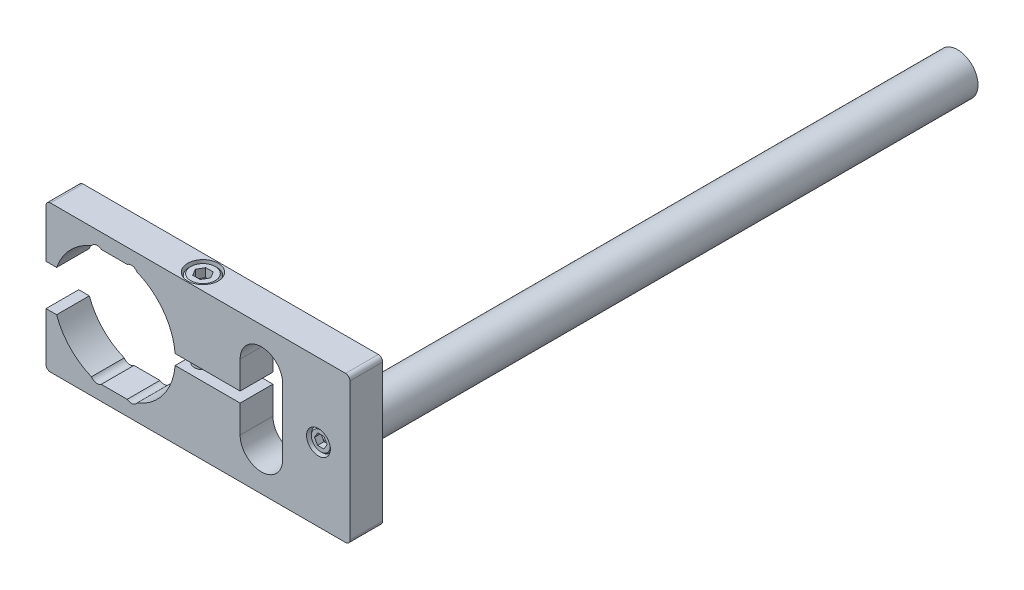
ISO-10303-21;
HEADER;
FILE_DESCRIPTION(('STEP AP214'),'2;1');
FILE_NAME('part.step','',(''),(''),'','','');
FILE_SCHEMA(('AUTOMOTIVE_DESIGN { 1 0 10303 214 1 1 1 1 }'));
ENDSEC;
DATA;
#1=APPLICATION_CONTEXT('core data for automotive mechanical design processes');
#2=APPLICATION_PROTOCOL_DEFINITION('international standard','automotive_design',2000,#1);
#3=PRODUCT_CONTEXT('',#1,'mechanical');
#4=PRODUCT('Part','Part','',(#3));
#5=PRODUCT_RELATED_PRODUCT_CATEGORY('part','',(#4));
#6=PRODUCT_DEFINITION_FORMATION('','',#4);
#7=PRODUCT_DEFINITION_CONTEXT('part definition',#1,'design');
#8=PRODUCT_DEFINITION('design','',#6,#7);
#9=PRODUCT_DEFINITION_SHAPE('','',#8);
#10=(LENGTH_UNIT() NAMED_UNIT(*) SI_UNIT(.MILLI.,.METRE.));
#11=(NAMED_UNIT(*) PLANE_ANGLE_UNIT() SI_UNIT($,.RADIAN.));
#12=(NAMED_UNIT(*) SI_UNIT($,.STERADIAN.) SOLID_ANGLE_UNIT());
#13=UNCERTAINTY_MEASURE_WITH_UNIT(LENGTH_MEASURE(1.E-05),#10,'distance_accuracy_value','');
#14=(GEOMETRIC_REPRESENTATION_CONTEXT(3) GLOBAL_UNCERTAINTY_ASSIGNED_CONTEXT((#13)) GLOBAL_UNIT_ASSIGNED_CONTEXT((#10,
#11,#12)) REPRESENTATION_CONTEXT('',''));
#15=CARTESIAN_POINT('',(0.,0.,0.));
#16=DIRECTION('',(0.,0.,1.));
#17=DIRECTION('',(1.,0.,0.));
#18=AXIS2_PLACEMENT_3D('',#15,#16,#17);
#19=CARTESIAN_POINT('',(95.0595,0.,30.65));
#20=DIRECTION('',(0.,0.,1.));
#21=DIRECTION('',(0.,1.,0.));
#22=AXIS2_PLACEMENT_3D('',#19,#20,#21);
#23=CYLINDRICAL_SURFACE('',#22,5.);
#24=CARTESIAN_POINT('',(95.0595,0.,-7.1));
#25=DIRECTION('',(0.,0.,1.));
#26=DIRECTION('',(0.,1.,0.));
#27=AXIS2_PLACEMENT_3D('',#24,#25,#26);
#28=CIRCLE('',#27,5.);
#29=CARTESIAN_POINT('',(95.0595,5.00000000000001,-7.1));
#30=VERTEX_POINT('',#29);
#31=EDGE_CURVE('E28',#30,#30,#28,.T.);
#32=ORIENTED_EDGE('',*,*,#31,.T.);
#33=EDGE_LOOP('',(#32));
#34=FACE_BOUND('',#33,.T.);
#35=CARTESIAN_POINT('',(95.0595,0.,-1.7));
#36=DIRECTION('',(0.,0.,1.));
#37=DIRECTION('',(0.,1.,0.));
#38=AXIS2_PLACEMENT_3D('',#35,#36,#37);
#39=CIRCLE('',#38,5.);
#40=CARTESIAN_POINT('',(95.0595,5.00000000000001,-1.7));
#41=VERTEX_POINT('',#40);
#42=EDGE_CURVE('E195',#41,#41,#39,.T.);
#43=ORIENTED_EDGE('',*,*,#42,.F.);
#44=EDGE_LOOP('',(#43));
#45=FACE_BOUND('',#44,.T.);
#46=ADVANCED_FACE('F17',(#34,#45),#23,.T.);
#47=CARTESIAN_POINT('',(95.0595,0.,-1.1));
#48=DIRECTION('',(0.,0.,-1.));
#49=DIRECTION('',(0.,-1.,0.));
#50=AXIS2_PLACEMENT_3D('',#47,#48,#49);
#51=CONICAL_SURFACE('',#50,4.4,0.785398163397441);
#52=ORIENTED_EDGE('',*,*,#42,.T.);
#53=EDGE_LOOP('',(#52));
#54=FACE_BOUND('',#53,.T.);
#55=CARTESIAN_POINT('',(95.0595,0.,-1.1));
#56=DIRECTION('',(0.,0.,1.));
#57=DIRECTION('',(0.,1.,0.));
#58=AXIS2_PLACEMENT_3D('',#55,#56,#57);
#59=CIRCLE('',#58,4.4);
#60=CARTESIAN_POINT('',(95.0595,4.40000000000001,-1.1));
#61=VERTEX_POINT('',#60);
#62=EDGE_CURVE('E204',#61,#61,#59,.T.);
#63=ORIENTED_EDGE('',*,*,#62,.F.);
#64=EDGE_LOOP('',(#63));
#65=FACE_BOUND('',#64,.T.);
#66=ADVANCED_FACE('F304',(#54,#65),#51,.T.);
#67=CARTESIAN_POINT('',(95.0595,0.,-1.1));
#68=DIRECTION('',(0.,0.,1.));
#69=DIRECTION('',(0.,1.,0.));
#70=AXIS2_PLACEMENT_3D('',#67,#68,#69);
#71=PLANE('',#70);
#72=DIRECTION('',(0.5,0.866025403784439,0.));
#73=VECTOR('',#72,1.);
#74=CARTESIAN_POINT('',(92.12425123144,0.,-1.1));
#75=LINE('',#74,#73);
#76=CARTESIAN_POINT('',(92.12425123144,0.,-1.1));
#77=VERTEX_POINT('',#76);
#78=CARTESIAN_POINT('',(93.59187561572,2.542,-1.1));
#79=VERTEX_POINT('',#78);
#80=EDGE_CURVE('E242',#77,#79,#75,.T.);
#81=ORIENTED_EDGE('',*,*,#80,.T.);
#82=DIRECTION('',(-1.,0.,0.));
#83=VECTOR('',#82,1.);
#84=CARTESIAN_POINT('',(96.52712438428,2.542,-1.1));
#85=LINE('',#84,#83);
#86=CARTESIAN_POINT('',(96.52712438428,2.542,-1.1));
#87=VERTEX_POINT('',#86);
#88=EDGE_CURVE('E245',#87,#79,#85,.T.);
#89=ORIENTED_EDGE('',*,*,#88,.F.);
#90=DIRECTION('',(0.5,-0.866025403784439,0.));
#91=VECTOR('',#90,1.);
#92=CARTESIAN_POINT('',(96.52712438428,2.542,-1.1));
#93=LINE('',#92,#91);
#94=CARTESIAN_POINT('',(97.9947487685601,0.,-1.1));
#95=VERTEX_POINT('',#94);
#96=EDGE_CURVE('E247',#87,#95,#93,.T.);
#97=ORIENTED_EDGE('',*,*,#96,.T.);
#98=DIRECTION('',(-0.5,-0.866025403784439,0.));
#99=VECTOR('',#98,1.);
#100=CARTESIAN_POINT('',(97.9947487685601,0.,-1.1));
#101=LINE('',#100,#99);
#102=CARTESIAN_POINT('',(96.52712438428,-2.542,-1.1));
#103=VERTEX_POINT('',#102);
#104=EDGE_CURVE('E250',#95,#103,#101,.T.);
#105=ORIENTED_EDGE('',*,*,#104,.T.);
#106=DIRECTION('',(1.,0.,0.));
#107=VECTOR('',#106,1.);
#108=CARTESIAN_POINT('',(93.59187561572,-2.542,-1.1));
#109=LINE('',#108,#107);
#110=CARTESIAN_POINT('',(93.59187561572,-2.542,-1.1));
#111=VERTEX_POINT('',#110);
#112=EDGE_CURVE('E253',#111,#103,#109,.T.);
#113=ORIENTED_EDGE('',*,*,#112,.F.);
#114=DIRECTION('',(0.5,-0.866025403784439,0.));
#115=VECTOR('',#114,1.);
#116=CARTESIAN_POINT('',(92.12425123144,0.,-1.1));
#117=LINE('',#116,#115);
#118=EDGE_CURVE('E255',#77,#111,#117,.T.);
#119=ORIENTED_EDGE('',*,*,#118,.F.);
#120=EDGE_LOOP('',(#81,#89,#97,#105,#113,#119));
#121=FACE_BOUND('',#120,.T.);
#122=ORIENTED_EDGE('',*,*,#62,.T.);
#123=EDGE_LOOP('',(#122));
#124=FACE_BOUND('',#123,.T.);
#125=ADVANCED_FACE('F301',(#121,#124),#71,.T.);
#126=CARTESIAN_POINT('',(92.12425123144,0.,-4.1));
#127=DIRECTION('',(0.866025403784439,-0.5,0.));
#128=DIRECTION('',(-0.5,-0.866025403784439,0.));
#129=AXIS2_PLACEMENT_3D('',#126,#127,#128);
#130=PLANE('',#129);
#131=ORIENTED_EDGE('',*,*,#80,.F.);
#132=DIRECTION('',(0.,0.,1.));
#133=VECTOR('',#132,1.);
#134=CARTESIAN_POINT('',(92.12425123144,0.,-4.1));
#135=LINE('',#134,#133);
#136=CARTESIAN_POINT('',(92.12425123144,0.,-4.1));
#137=VERTEX_POINT('',#136);
#138=EDGE_CURVE('E241',#137,#77,#135,.T.);
#139=ORIENTED_EDGE('',*,*,#138,.F.);
#140=DIRECTION('',(0.5,0.866025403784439,0.));
#141=VECTOR('',#140,1.);
#142=CARTESIAN_POINT('',(92.12425123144,0.,-4.1));
#143=LINE('',#142,#141);
#144=CARTESIAN_POINT('',(92.85806342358,1.27100000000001,-4.1));
#145=VERTEX_POINT('',#144);
#146=EDGE_CURVE('E225',#137,#145,#143,.T.);
#147=ORIENTED_EDGE('',*,*,#146,.T.);
#148=CARTESIAN_POINT('',(93.59187561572,2.542,-4.1));
#149=VERTEX_POINT('',#148);
#150=EDGE_CURVE('E229',#145,#149,#143,.T.);
#151=ORIENTED_EDGE('',*,*,#150,.T.);
#152=DIRECTION('',(0.,0.,1.));
#153=VECTOR('',#152,1.);
#154=CARTESIAN_POINT('',(93.59187561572,2.542,-4.1));
#155=LINE('',#154,#153);
#156=EDGE_CURVE('E197',#149,#79,#155,.T.);
#157=ORIENTED_EDGE('',*,*,#156,.T.);
#158=EDGE_LOOP('',(#131,#139,#147,#151,#157));
#159=FACE_BOUND('',#158,.T.);
#160=ADVANCED_FACE('F290',(#159),#130,.T.);
#161=CARTESIAN_POINT('',(96.52712438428,2.542,-4.1));
#162=DIRECTION('',(0.,1.,0.));
#163=DIRECTION('',(1.,0.,0.));
#164=AXIS2_PLACEMENT_3D('',#161,#162,#163);
#165=PLANE('',#164);
#166=ORIENTED_EDGE('',*,*,#88,.T.);
#167=ORIENTED_EDGE('',*,*,#156,.F.);
#168=DIRECTION('',(-1.,0.,0.));
#169=VECTOR('',#168,1.);
#170=CARTESIAN_POINT('',(96.52712438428,2.542,-4.1));
#171=LINE('',#170,#169);
#172=CARTESIAN_POINT('',(95.0595,2.542,-4.1));
#173=VERTEX_POINT('',#172);
#174=EDGE_CURVE('E228',#173,#149,#171,.T.);
#175=ORIENTED_EDGE('',*,*,#174,.F.);
#176=CARTESIAN_POINT('',(96.52712438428,2.542,-4.1));
#177=VERTEX_POINT('',#176);
#178=EDGE_CURVE('E230',#177,#173,#171,.T.);
#179=ORIENTED_EDGE('',*,*,#178,.F.);
#180=DIRECTION('',(0.,0.,1.));
#181=VECTOR('',#180,1.);
#182=CARTESIAN_POINT('',(96.52712438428,2.542,-4.1));
#183=LINE('',#182,#181);
#184=EDGE_CURVE('E265',#177,#87,#183,.T.);
#185=ORIENTED_EDGE('',*,*,#184,.T.);
#186=EDGE_LOOP('',(#166,#167,#175,#179,#185));
#187=FACE_BOUND('',#186,.T.);
#188=ADVANCED_FACE('F286',(#187),#165,.F.);
#189=CARTESIAN_POINT('',(96.52712438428,2.542,-4.1));
#190=DIRECTION('',(-0.866025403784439,-0.5,0.));
#191=DIRECTION('',(-0.5,0.866025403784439,0.));
#192=AXIS2_PLACEMENT_3D('',#189,#190,#191);
#193=PLANE('',#192);
#194=ORIENTED_EDGE('',*,*,#96,.F.);
#195=ORIENTED_EDGE('',*,*,#184,.F.);
#196=DIRECTION('',(0.5,-0.866025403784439,0.));
#197=VECTOR('',#196,1.);
#198=CARTESIAN_POINT('',(96.52712438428,2.542,-4.1));
#199=LINE('',#198,#197);
#200=CARTESIAN_POINT('',(97.26093657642,1.27100000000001,-4.1));
#201=VERTEX_POINT('',#200);
#202=EDGE_CURVE('E234',#177,#201,#199,.T.);
#203=ORIENTED_EDGE('',*,*,#202,.T.);
#204=CARTESIAN_POINT('',(97.9947487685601,0.,-4.1));
#205=VERTEX_POINT('',#204);
#206=EDGE_CURVE('E233',#201,#205,#199,.T.);
#207=ORIENTED_EDGE('',*,*,#206,.T.);
#208=DIRECTION('',(0.,0.,1.));
#209=VECTOR('',#208,1.);
#210=CARTESIAN_POINT('',(97.9947487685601,0.,-4.1));
#211=LINE('',#210,#209);
#212=EDGE_CURVE('E263',#205,#95,#211,.T.);
#213=ORIENTED_EDGE('',*,*,#212,.T.);
#214=EDGE_LOOP('',(#194,#195,#203,#207,#213));
#215=FACE_BOUND('',#214,.T.);
#216=ADVANCED_FACE('F282',(#215),#193,.T.);
#217=CARTESIAN_POINT('',(97.9947487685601,0.,-4.1));
#218=DIRECTION('',(-0.866025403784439,0.5,0.));
#219=DIRECTION('',(0.5,0.866025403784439,0.));
#220=AXIS2_PLACEMENT_3D('',#217,#218,#219);
#221=PLANE('',#220);
#222=ORIENTED_EDGE('',*,*,#104,.F.);
#223=ORIENTED_EDGE('',*,*,#212,.F.);
#224=DIRECTION('',(-0.5,-0.866025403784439,0.));
#225=VECTOR('',#224,1.);
#226=CARTESIAN_POINT('',(97.9947487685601,0.,-4.1));
#227=LINE('',#226,#225);
#228=CARTESIAN_POINT('',(97.2609365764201,-1.27099999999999,-4.1));
#229=VERTEX_POINT('',#228);
#230=EDGE_CURVE('E178',#205,#229,#227,.T.);
#231=ORIENTED_EDGE('',*,*,#230,.T.);
#232=CARTESIAN_POINT('',(96.52712438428,-2.542,-4.1));
#233=VERTEX_POINT('',#232);
#234=EDGE_CURVE('E182',#229,#233,#227,.T.);
#235=ORIENTED_EDGE('',*,*,#234,.T.);
#236=DIRECTION('',(0.,0.,1.));
#237=VECTOR('',#236,1.);
#238=CARTESIAN_POINT('',(96.52712438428,-2.542,-4.1));
#239=LINE('',#238,#237);
#240=EDGE_CURVE('E174',#233,#103,#239,.T.);
#241=ORIENTED_EDGE('',*,*,#240,.T.);
#242=EDGE_LOOP('',(#222,#223,#231,#235,#241));
#243=FACE_BOUND('',#242,.T.);
#244=ADVANCED_FACE('F300',(#243),#221,.T.);
#245=CARTESIAN_POINT('',(93.59187561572,-2.542,-4.1));
#246=DIRECTION('',(0.,-1.,0.));
#247=DIRECTION('',(-1.,0.,0.));
#248=AXIS2_PLACEMENT_3D('',#245,#246,#247);
#249=PLANE('',#248);
#250=ORIENTED_EDGE('',*,*,#112,.T.);
#251=ORIENTED_EDGE('',*,*,#240,.F.);
#252=DIRECTION('',(1.,0.,0.));
#253=VECTOR('',#252,1.);
#254=CARTESIAN_POINT('',(93.59187561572,-2.542,-4.1));
#255=LINE('',#254,#253);
#256=CARTESIAN_POINT('',(95.0595,-2.542,-4.1));
#257=VERTEX_POINT('',#256);
#258=EDGE_CURVE('E168',#257,#233,#255,.T.);
#259=ORIENTED_EDGE('',*,*,#258,.F.);
#260=CARTESIAN_POINT('',(93.59187561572,-2.542,-4.1));
#261=VERTEX_POINT('',#260);
#262=EDGE_CURVE('E158',#261,#257,#255,.T.);
#263=ORIENTED_EDGE('',*,*,#262,.F.);
#264=DIRECTION('',(0.,0.,1.));
#265=VECTOR('',#264,1.);
#266=CARTESIAN_POINT('',(93.59187561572,-2.542,-4.1));
#267=LINE('',#266,#265);
#268=EDGE_CURVE('E260',#261,#111,#267,.T.);
#269=ORIENTED_EDGE('',*,*,#268,.T.);
#270=EDGE_LOOP('',(#250,#251,#259,#263,#269));
#271=FACE_BOUND('',#270,.T.);
#272=ADVANCED_FACE('F172',(#271),#249,.F.);
#273=CARTESIAN_POINT('',(92.12425123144,0.,-4.1));
#274=DIRECTION('',(-0.866025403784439,-0.5,0.));
#275=DIRECTION('',(-0.5,0.866025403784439,0.));
#276=AXIS2_PLACEMENT_3D('',#273,#274,#275);
#277=PLANE('',#276);
#278=ORIENTED_EDGE('',*,*,#118,.T.);
#279=ORIENTED_EDGE('',*,*,#268,.F.);
#280=DIRECTION('',(0.5,-0.866025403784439,0.));
#281=VECTOR('',#280,1.);
#282=CARTESIAN_POINT('',(92.12425123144,0.,-4.1));
#283=LINE('',#282,#281);
#284=CARTESIAN_POINT('',(92.85806342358,-1.27099999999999,-4.1));
#285=VERTEX_POINT('',#284);
#286=EDGE_CURVE('E164',#285,#261,#283,.T.);
#287=ORIENTED_EDGE('',*,*,#286,.F.);
#288=EDGE_CURVE('E238',#137,#285,#283,.T.);
#289=ORIENTED_EDGE('',*,*,#288,.F.);
#290=ORIENTED_EDGE('',*,*,#138,.T.);
#291=EDGE_LOOP('',(#278,#279,#287,#289,#290));
#292=FACE_BOUND('',#291,.T.);
#293=ADVANCED_FACE('F296',(#292),#277,.F.);
#294=CARTESIAN_POINT('',(92.12425123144,0.,-4.1));
#295=DIRECTION('',(0.,0.,-1.));
#296=DIRECTION('',(0.,-1.,0.));
#297=AXIS2_PLACEMENT_3D('',#294,#295,#296);
#298=PLANE('',#297);
#299=ORIENTED_EDGE('',*,*,#146,.F.);
#300=ORIENTED_EDGE('',*,*,#288,.T.);
#301=CARTESIAN_POINT('',(95.0595,0.,-4.1));
#302=DIRECTION('',(0.,0.,1.));
#303=DIRECTION('',(0.,1.,0.));
#304=AXIS2_PLACEMENT_3D('',#301,#302,#303);
#305=CIRCLE('',#304,2.542);
#306=EDGE_CURVE('E191',#145,#285,#305,.T.);
#307=ORIENTED_EDGE('',*,*,#306,.F.);
#308=EDGE_LOOP('',(#299,#300,#307));
#309=FACE_BOUND('',#308,.T.);
#310=ADVANCED_FACE('F294',(#309),#298,.F.);
#311=ORIENTED_EDGE('',*,*,#174,.T.);
#312=ORIENTED_EDGE('',*,*,#150,.F.);
#313=EDGE_CURVE('E192',#173,#145,#305,.T.);
#314=ORIENTED_EDGE('',*,*,#313,.F.);
#315=EDGE_LOOP('',(#311,#312,#314));
#316=FACE_BOUND('',#315,.T.);
#317=ADVANCED_FACE('F289',(#316),#298,.F.);
#318=ORIENTED_EDGE('',*,*,#202,.F.);
#319=ORIENTED_EDGE('',*,*,#178,.T.);
#320=EDGE_CURVE('E196',#201,#173,#305,.T.);
#321=ORIENTED_EDGE('',*,*,#320,.F.);
#322=EDGE_LOOP('',(#318,#319,#321));
#323=FACE_BOUND('',#322,.T.);
#324=ADVANCED_FACE('F284',(#323),#298,.F.);
#325=ORIENTED_EDGE('',*,*,#230,.F.);
#326=ORIENTED_EDGE('',*,*,#206,.F.);
#327=EDGE_CURVE('E186',#229,#201,#305,.T.);
#328=ORIENTED_EDGE('',*,*,#327,.F.);
#329=EDGE_LOOP('',(#325,#326,#328));
#330=FACE_BOUND('',#329,.T.);
#331=ADVANCED_FACE('F278',(#330),#298,.F.);
#332=ORIENTED_EDGE('',*,*,#258,.T.);
#333=ORIENTED_EDGE('',*,*,#234,.F.);
#334=EDGE_CURVE('E180',#257,#229,#305,.T.);
#335=ORIENTED_EDGE('',*,*,#334,.F.);
#336=EDGE_LOOP('',(#332,#333,#335));
#337=FACE_BOUND('',#336,.T.);
#338=ADVANCED_FACE('F181',(#337),#298,.F.);
#339=ORIENTED_EDGE('',*,*,#286,.T.);
#340=ORIENTED_EDGE('',*,*,#262,.T.);
#341=EDGE_CURVE('E162',#285,#257,#305,.T.);
#342=ORIENTED_EDGE('',*,*,#341,.F.);
#343=EDGE_LOOP('',(#339,#340,#342));
#344=FACE_BOUND('',#343,.T.);
#345=ADVANCED_FACE('F160',(#344),#298,.F.);
#346=CARTESIAN_POINT('',(95.0595,0.,-4.1));
#347=DIRECTION('',(0.,0.,1.));
#348=DIRECTION('',(0.,1.,0.));
#349=AXIS2_PLACEMENT_3D('',#346,#347,#348);
#350=CONICAL_SURFACE('',#349,2.542,1.0471975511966);
#351=CARTESIAN_POINT('',(95.0595,0.,-5.56762438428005));
#352=VERTEX_POINT('',#351);
#353=VERTEX_LOOP('',#352);
#354=FACE_BOUND('',#353,.T.);
#355=ORIENTED_EDGE('',*,*,#313,.T.);
#356=ORIENTED_EDGE('',*,*,#306,.T.);
#357=ORIENTED_EDGE('',*,*,#341,.T.);
#358=ORIENTED_EDGE('',*,*,#334,.T.);
#359=ORIENTED_EDGE('',*,*,#327,.T.);
#360=ORIENTED_EDGE('',*,*,#320,.T.);
#361=EDGE_LOOP('',(#355,#356,#357,#358,#359,#360));
#362=FACE_BOUND('',#361,.T.);
#363=ADVANCED_FACE('F190',(#354,#362),#350,.F.);
#364=CARTESIAN_POINT('',(95.0595,0.,-12.954));
#365=DIRECTION('',(0.,0.,-1.));
#366=DIRECTION('',(1.,0.,0.));
#367=AXIS2_PLACEMENT_3D('',#364,#365,#366);
#368=CYLINDRICAL_SURFACE('',#367,9.51865);
#369=CARTESIAN_POINT('',(95.0595,0.,-12.954));
#370=DIRECTION('',(0.,0.,1.));
#371=DIRECTION('',(-1.,0.,0.));
#372=AXIS2_PLACEMENT_3D('',#369,#370,#371);
#373=CIRCLE('',#372,9.51865);
#374=CARTESIAN_POINT('',(85.54085,0.,-12.954));
#375=VERTEX_POINT('',#374);
#376=EDGE_CURVE('E201',#375,#375,#373,.T.);
#377=ORIENTED_EDGE('',*,*,#376,.F.);
#378=EDGE_LOOP('',(#377));
#379=FACE_BOUND('',#378,.T.);
#380=CARTESIAN_POINT('',(95.0595,0.,-297.49399999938));
#381=DIRECTION('',(0.,0.,1.));
#382=DIRECTION('',(-1.,0.,0.));
#383=AXIS2_PLACEMENT_3D('',#380,#381,#382);
#384=CIRCLE('',#383,9.51865);
#385=CARTESIAN_POINT('',(85.54085,0.,-297.49399999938));
#386=VERTEX_POINT('',#385);
#387=EDGE_CURVE('E211',#386,#386,#384,.T.);
#388=ORIENTED_EDGE('',*,*,#387,.T.);
#389=EDGE_LOOP('',(#388));
#390=FACE_BOUND('',#389,.T.);
#391=ADVANCED_FACE('F419',(#379,#390),#368,.T.);
#392=CARTESIAN_POINT('',(95.0595,0.,-297.49399999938));
#393=DIRECTION('',(0.,0.,1.));
#394=DIRECTION('',(-1.,0.,0.));
#395=AXIS2_PLACEMENT_3D('',#392,#393,#394);
#396=PLANE('',#395);
#397=ORIENTED_EDGE('',*,*,#387,.F.);
#398=EDGE_LOOP('',(#397));
#399=FACE_BOUND('',#398,.T.);
#400=ADVANCED_FACE('F405',(#399),#396,.F.);
#401=CARTESIAN_POINT('',(98.6295,0.,-7.1));
#402=DIRECTION('',(0.,0.,-1.));
#403=DIRECTION('',(-1.,0.,0.));
#404=AXIS2_PLACEMENT_3D('',#401,#402,#403);
#405=PLANE('',#404);
#406=ORIENTED_EDGE('',*,*,#31,.F.);
#407=EDGE_LOOP('',(#406));
#408=FACE_BOUND('',#407,.T.);
#409=CARTESIAN_POINT('',(95.0595,0.,-7.1));
#410=DIRECTION('',(0.,0.,1.));
#411=DIRECTION('',(1.,0.,0.));
#412=AXIS2_PLACEMENT_3D('',#409,#410,#411);
#413=CIRCLE('',#412,5.55);
#414=CARTESIAN_POINT('',(100.6095,0.,-7.1));
#415=VERTEX_POINT('',#414);
#416=EDGE_CURVE('E566',#415,#415,#413,.T.);
#417=ORIENTED_EDGE('',*,*,#416,.T.);
#418=EDGE_LOOP('',(#417));
#419=FACE_BOUND('',#418,.T.);
#420=ADVANCED_FACE('F410',(#408,#419),#405,.F.);
#421=CARTESIAN_POINT('',(95.0595,0.,0.));
#422=DIRECTION('',(0.,0.,1.));
#423=DIRECTION('',(1.,0.,0.));
#424=AXIS2_PLACEMENT_3D('',#421,#422,#423);
#425=CYLINDRICAL_SURFACE('',#424,5.55);
#426=ORIENTED_EDGE('',*,*,#416,.F.);
#427=EDGE_LOOP('',(#426));
#428=FACE_BOUND('',#427,.T.);
#429=CARTESIAN_POINT('',(95.0595,0.,0.));
#430=DIRECTION('',(0.,0.,1.));
#431=DIRECTION('',(1.,0.,0.));
#432=AXIS2_PLACEMENT_3D('',#429,#430,#431);
#433=CIRCLE('',#432,5.55);
#434=CARTESIAN_POINT('',(100.6095,0.,0.));
#435=VERTEX_POINT('',#434);
#436=EDGE_CURVE('E660',#435,#435,#433,.T.);
#437=ORIENTED_EDGE('',*,*,#436,.T.);
#438=EDGE_LOOP('',(#437));
#439=FACE_BOUND('',#438,.T.);
#440=ADVANCED_FACE('F1091',(#428,#439),#425,.F.);
#441=CARTESIAN_POINT('',(95.0595,0.,-12.954));
#442=DIRECTION('',(0.,0.,-1.));
#443=DIRECTION('',(-1.,0.,0.));
#444=AXIS2_PLACEMENT_3D('',#441,#442,#443);
#445=PLANE('',#444);
#446=ORIENTED_EDGE('',*,*,#376,.T.);
#447=EDGE_LOOP('',(#446));
#448=FACE_BOUND('',#447,.T.);
#449=CARTESIAN_POINT('',(95.0595,0.,-12.954));
#450=DIRECTION('',(0.,0.,-1.));
#451=DIRECTION('',(-1.,0.,0.));
#452=AXIS2_PLACEMENT_3D('',#449,#450,#451);
#453=CIRCLE('',#452,10.16);
#454=CARTESIAN_POINT('',(84.8995,0.,-12.954));
#455=VERTEX_POINT('',#454);
#456=EDGE_CURVE('E661',#455,#455,#453,.T.);
#457=ORIENTED_EDGE('',*,*,#456,.T.);
#458=EDGE_LOOP('',(#457));
#459=FACE_BOUND('',#458,.T.);
#460=ADVANCED_FACE('F1088',(#448,#459),#445,.T.);
#461=CARTESIAN_POINT('',(95.0595,0.,-12.954));
#462=DIRECTION('',(0.,0.,-1.));
#463=DIRECTION('',(-1.,0.,0.));
#464=AXIS2_PLACEMENT_3D('',#461,#462,#463);
#465=CYLINDRICAL_SURFACE('',#464,10.16);
#466=ORIENTED_EDGE('',*,*,#456,.F.);
#467=EDGE_LOOP('',(#466));
#468=FACE_BOUND('',#467,.T.);
#469=CARTESIAN_POINT('',(95.0595,0.,-15.24));
#470=DIRECTION('',(0.,0.,-1.));
#471=DIRECTION('',(-1.,0.,0.));
#472=AXIS2_PLACEMENT_3D('',#469,#470,#471);
#473=CIRCLE('',#472,10.16);
#474=CARTESIAN_POINT('',(84.8995,0.,-15.24));
#475=VERTEX_POINT('',#474);
#476=EDGE_CURVE('E842',#475,#475,#473,.T.);
#477=ORIENTED_EDGE('',*,*,#476,.T.);
#478=EDGE_LOOP('',(#477));
#479=FACE_BOUND('',#478,.T.);
#480=ADVANCED_FACE('F1086',(#468,#479),#465,.F.);
#481=CARTESIAN_POINT('',(33.6922241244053,34.0995,-7.62));
#482=DIRECTION('',(0.,1.,0.));
#483=DIRECTION('',(0.,0.,1.));
#484=AXIS2_PLACEMENT_3D('',#481,#482,#483);
#485=CYLINDRICAL_SURFACE('',#484,4.37);
#486=CARTESIAN_POINT('',(33.6922241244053,2.413,-7.62));
#487=DIRECTION('',(0.,-1.,0.));
#488=DIRECTION('',(0.,0.,-1.));
#489=AXIS2_PLACEMENT_3D('',#486,#487,#488);
#490=CIRCLE('',#489,4.37);
#491=CARTESIAN_POINT('',(33.6922241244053,2.413,-11.99));
#492=VERTEX_POINT('',#491);
#493=EDGE_CURVE('E839',#492,#492,#490,.T.);
#494=ORIENTED_EDGE('',*,*,#493,.T.);
#495=EDGE_LOOP('',(#494));
#496=FACE_BOUND('',#495,.T.);
#497=CARTESIAN_POINT('',(33.6922241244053,25.4983734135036,-7.62000000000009));
#498=DIRECTION('',(0.,-1.,0.));
#499=DIRECTION('',(1.,0.,0.));
#500=AXIS2_PLACEMENT_3D('',#497,#498,#499);
#501=CIRCLE('',#500,4.37);
#502=CARTESIAN_POINT('',(38.0622241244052,25.4983734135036,-7.62000000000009));
#503=VERTEX_POINT('',#502);
#504=EDGE_CURVE('E21',#503,#503,#501,.T.);
#505=ORIENTED_EDGE('',*,*,#504,.F.);
#506=EDGE_LOOP('',(#505));
#507=FACE_BOUND('',#506,.T.);
#508=ADVANCED_FACE('F528',(#496,#507),#485,.F.);
#509=CARTESIAN_POINT('',(38.989,2.413,-15.24));
#510=DIRECTION('',(0.,-1.,0.));
#511=DIRECTION('',(0.,0.,-1.));
#512=AXIS2_PLACEMENT_3D('',#509,#510,#511);
#513=PLANE('',#512);
#514=DIRECTION('',(0.,0.,-1.));
#515=VECTOR('',#514,1.);
#516=CARTESIAN_POINT('',(58.6105,2.413,-15.24));
#517=LINE('',#516,#515);
#518=CARTESIAN_POINT('',(58.6105,2.413,0.));
#519=VERTEX_POINT('',#518);
#520=CARTESIAN_POINT('',(58.6105,2.413,-15.24));
#521=VERTEX_POINT('',#520);
#522=EDGE_CURVE('E819',#519,#521,#517,.T.);
#523=ORIENTED_EDGE('',*,*,#522,.F.);
#524=DIRECTION('',(1.,0.,0.));
#525=VECTOR('',#524,1.);
#526=CARTESIAN_POINT('',(38.989,2.413,0.));
#527=LINE('',#526,#525);
#528=CARTESIAN_POINT('',(28.3582241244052,2.413,0.));
#529=VERTEX_POINT('',#528);
#530=EDGE_CURVE('E577',#529,#519,#527,.T.);
#531=ORIENTED_EDGE('',*,*,#530,.F.);
#532=DIRECTION('',(0.,0.,1.));
#533=VECTOR('',#532,1.);
#534=CARTESIAN_POINT('',(28.3582241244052,2.413,-15.24));
#535=LINE('',#534,#533);
#536=CARTESIAN_POINT('',(28.3582241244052,2.413,-15.24));
#537=VERTEX_POINT('',#536);
#538=EDGE_CURVE('E646',#537,#529,#535,.T.);
#539=ORIENTED_EDGE('',*,*,#538,.F.);
#540=DIRECTION('',(1.,0.,0.));
#541=VECTOR('',#540,1.);
#542=CARTESIAN_POINT('',(38.989,2.413,-15.24));
#543=LINE('',#542,#541);
#544=EDGE_CURVE('E863',#537,#521,#543,.T.);
#545=ORIENTED_EDGE('',*,*,#544,.T.);
#546=EDGE_LOOP('',(#523,#531,#539,#545));
#547=FACE_BOUND('',#546,.T.);
#548=ORIENTED_EDGE('',*,*,#493,.F.);
#549=EDGE_LOOP('',(#548));
#550=FACE_BOUND('',#549,.T.);
#551=ADVANCED_FACE('F525',(#547,#550),#513,.T.);
#552=CARTESIAN_POINT('',(58.6105,15.3035,-15.24));
#553=DIRECTION('',(-1.,0.,0.));
#554=DIRECTION('',(0.,0.,1.));
#555=AXIS2_PLACEMENT_3D('',#552,#553,#554);
#556=PLANE('',#555);
#557=ORIENTED_EDGE('',*,*,#522,.T.);
#558=DIRECTION('',(0.,-1.,0.));
#559=VECTOR('',#558,1.);
#560=CARTESIAN_POINT('',(58.6105,15.3035,-15.24));
#561=LINE('',#560,#559);
#562=CARTESIAN_POINT('',(58.6105,15.3035,-15.24));
#563=VERTEX_POINT('',#562);
#564=EDGE_CURVE('E802',#563,#521,#561,.T.);
#565=ORIENTED_EDGE('',*,*,#564,.F.);
#566=DIRECTION('',(0.,0.,1.));
#567=VECTOR('',#566,1.);
#568=CARTESIAN_POINT('',(58.6105,15.3035,-15.24));
#569=LINE('',#568,#567);
#570=CARTESIAN_POINT('',(58.6105,15.3035,0.));
#571=VERTEX_POINT('',#570);
#572=EDGE_CURVE('E808',#563,#571,#569,.T.);
#573=ORIENTED_EDGE('',*,*,#572,.T.);
#574=DIRECTION('',(0.,-1.,0.));
#575=VECTOR('',#574,1.);
#576=CARTESIAN_POINT('',(58.6105,15.3035,0.));
#577=LINE('',#576,#575);
#578=EDGE_CURVE('E811',#571,#519,#577,.T.);
#579=ORIENTED_EDGE('',*,*,#578,.T.);
#580=EDGE_LOOP('',(#557,#565,#573,#579));
#581=FACE_BOUND('',#580,.T.);
#582=ADVANCED_FACE('F518',(#581),#556,.F.);
#583=CARTESIAN_POINT('',(38.989,-2.413,-15.24));
#584=DIRECTION('',(0.,-1.,0.));
#585=DIRECTION('',(1.,0.,0.));
#586=AXIS2_PLACEMENT_3D('',#583,#584,#585);
#587=PLANE('',#586);
#588=CARTESIAN_POINT('',(33.6922241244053,-2.413,-7.62000000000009));
#589=DIRECTION('',(0.,-1.,0.));
#590=DIRECTION('',(1.,0.,0.));
#591=AXIS2_PLACEMENT_3D('',#588,#589,#590);
#592=CIRCLE('',#591,4.);
#593=CARTESIAN_POINT('',(37.6922241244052,-2.413,-7.62000000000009));
#594=VERTEX_POINT('',#593);
#595=EDGE_CURVE('E10',#594,#594,#592,.T.);
#596=ORIENTED_EDGE('',*,*,#595,.T.);
#597=EDGE_LOOP('',(#596));
#598=FACE_BOUND('',#597,.T.);
#599=DIRECTION('',(1.,0.,0.));
#600=VECTOR('',#599,1.);
#601=CARTESIAN_POINT('',(38.989,-2.413,0.));
#602=LINE('',#601,#600);
#603=CARTESIAN_POINT('',(28.3582241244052,-2.413,0.));
#604=VERTEX_POINT('',#603);
#605=CARTESIAN_POINT('',(58.6105,-2.413,0.));
#606=VERTEX_POINT('',#605);
#607=EDGE_CURVE('E585',#604,#606,#602,.T.);
#608=ORIENTED_EDGE('',*,*,#607,.T.);
#609=DIRECTION('',(0.,0.,-1.));
#610=VECTOR('',#609,1.);
#611=CARTESIAN_POINT('',(58.6105,-2.413,-15.24));
#612=LINE('',#611,#610);
#613=CARTESIAN_POINT('',(58.6105,-2.413,-15.24));
#614=VERTEX_POINT('',#613);
#615=EDGE_CURVE('E830',#606,#614,#612,.T.);
#616=ORIENTED_EDGE('',*,*,#615,.T.);
#617=DIRECTION('',(1.,0.,0.));
#618=VECTOR('',#617,1.);
#619=CARTESIAN_POINT('',(38.989,-2.413,-15.24));
#620=LINE('',#619,#618);
#621=CARTESIAN_POINT('',(28.3582241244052,-2.413,-15.24));
#622=VERTEX_POINT('',#621);
#623=EDGE_CURVE('E870',#622,#614,#620,.T.);
#624=ORIENTED_EDGE('',*,*,#623,.F.);
#625=DIRECTION('',(0.,0.,1.));
#626=VECTOR('',#625,1.);
#627=CARTESIAN_POINT('',(28.3582241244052,-2.413,-15.24));
#628=LINE('',#627,#626);
#629=EDGE_CURVE('E643',#622,#604,#628,.T.);
#630=ORIENTED_EDGE('',*,*,#629,.T.);
#631=EDGE_LOOP('',(#608,#616,#624,#630));
#632=FACE_BOUND('',#631,.T.);
#633=ADVANCED_FACE('F473',(#598,#632),#587,.F.);
#634=CARTESIAN_POINT('',(38.989,-122.303659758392,0.));
#635=DIRECTION('',(0.,0.,1.));
#636=DIRECTION('',(1.,0.,0.));
#637=AXIS2_PLACEMENT_3D('',#634,#635,#636);
#638=PLANE('',#637);
#639=DIRECTION('',(1.,0.,0.));
#640=VECTOR('',#639,1.);
#641=CARTESIAN_POINT('',(38.989,-34.0995,0.));
#642=LINE('',#641,#640);
#643=CARTESIAN_POINT('',(-29.718,-34.0995,0.));
#644=VERTEX_POINT('',#643);
#645=CARTESIAN_POINT('',(107.696,-34.0995,0.));
#646=VERTEX_POINT('',#645);
#647=EDGE_CURVE('E604',#644,#646,#642,.T.);
#648=ORIENTED_EDGE('',*,*,#647,.T.);
#649=CARTESIAN_POINT('',(107.696,-32.0675,0.));
#650=DIRECTION('',(0.,0.,1.));
#651=DIRECTION('',(1.,0.,0.));
#652=AXIS2_PLACEMENT_3D('',#649,#650,#651);
#653=CIRCLE('',#652,2.032);
#654=CARTESIAN_POINT('',(109.728,-32.0675,0.));
#655=VERTEX_POINT('',#654);
#656=EDGE_CURVE('E679',#646,#655,#653,.T.);
#657=ORIENTED_EDGE('',*,*,#656,.T.);
#658=DIRECTION('',(0.,-1.,0.));
#659=VECTOR('',#658,1.);
#660=CARTESIAN_POINT('',(109.728,-122.303659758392,0.));
#661=LINE('',#660,#659);
#662=CARTESIAN_POINT('',(109.728,32.0675,0.));
#663=VERTEX_POINT('',#662);
#664=EDGE_CURVE('E608',#663,#655,#661,.T.);
#665=ORIENTED_EDGE('',*,*,#664,.F.);
#666=CARTESIAN_POINT('',(107.696,32.0675,0.));
#667=DIRECTION('',(0.,0.,1.));
#668=DIRECTION('',(1.,0.,0.));
#669=AXIS2_PLACEMENT_3D('',#666,#667,#668);
#670=CIRCLE('',#669,2.032);
#671=CARTESIAN_POINT('',(107.696,34.0995,0.));
#672=VERTEX_POINT('',#671);
#673=EDGE_CURVE('E670',#663,#672,#670,.T.);
#674=ORIENTED_EDGE('',*,*,#673,.T.);
#675=DIRECTION('',(1.,0.,0.));
#676=VECTOR('',#675,1.);
#677=CARTESIAN_POINT('',(38.989,34.0995,0.));
#678=LINE('',#677,#676);
#679=CARTESIAN_POINT('',(-29.718,34.0995,0.));
#680=VERTEX_POINT('',#679);
#681=EDGE_CURVE('E611',#680,#672,#678,.T.);
#682=ORIENTED_EDGE('',*,*,#681,.F.);
#683=CARTESIAN_POINT('',(-29.718,32.0675,0.));
#684=DIRECTION('',(0.,0.,1.));
#685=DIRECTION('',(1.,0.,0.));
#686=AXIS2_PLACEMENT_3D('',#683,#684,#685);
#687=CIRCLE('',#686,2.032);
#688=CARTESIAN_POINT('',(-31.75,32.0675,0.));
#689=VERTEX_POINT('',#688);
#690=EDGE_CURVE('E673',#680,#689,#687,.T.);
#691=ORIENTED_EDGE('',*,*,#690,.T.);
#692=DIRECTION('',(0.,-1.,0.));
#693=VECTOR('',#692,1.);
#694=CARTESIAN_POINT('',(-31.75,-122.303659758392,0.));
#695=LINE('',#694,#693);
#696=CARTESIAN_POINT('',(-31.75,9.525,0.));
#697=VERTEX_POINT('',#696);
#698=EDGE_CURVE('E605',#689,#697,#695,.T.);
#699=ORIENTED_EDGE('',*,*,#698,.T.);
#700=DIRECTION('',(1.,0.,0.));
#701=VECTOR('',#700,1.);
#702=CARTESIAN_POINT('',(38.989,9.525,0.));
#703=LINE('',#702,#701);
#704=CARTESIAN_POINT('',(-26.8195044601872,9.525,0.));
#705=VERTEX_POINT('',#704);
#706=EDGE_CURVE('E614',#697,#705,#703,.T.);
#707=ORIENTED_EDGE('',*,*,#706,.T.);
#708=CARTESIAN_POINT('',(0.,0.,0.));
#709=DIRECTION('',(0.,0.,1.));
#710=DIRECTION('',(1.,0.,0.));
#711=AXIS2_PLACEMENT_3D('',#708,#709,#710);
#712=CIRCLE('',#711,28.4607);
#713=CARTESIAN_POINT('',(-10.5971745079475,26.414226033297,0.));
#714=VERTEX_POINT('',#713);
#715=EDGE_CURVE('E578',#714,#705,#712,.T.);
#716=ORIENTED_EDGE('',*,*,#715,.F.);
#717=CARTESIAN_POINT('',(-7.9485459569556,24.6634,0.));
#718=DIRECTION('',(0.,0.,1.));
#719=DIRECTION('',(1.,0.,0.));
#720=AXIS2_PLACEMENT_3D('',#717,#718,#719);
#721=CIRCLE('',#720,3.175);
#722=CARTESIAN_POINT('',(-6.0267291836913,27.1907,0.));
#723=VERTEX_POINT('',#722);
#724=EDGE_CURVE('E547',#723,#714,#721,.T.);
#725=ORIENTED_EDGE('',*,*,#724,.F.);
#726=DIRECTION('',(1.,0.,0.));
#727=VECTOR('',#726,1.);
#728=CARTESIAN_POINT('',(38.989,27.1907,0.));
#729=LINE('',#728,#727);
#730=CARTESIAN_POINT('',(6.0267291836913,27.1907,0.));
#731=VERTEX_POINT('',#730);
#732=EDGE_CURVE('E561',#723,#731,#729,.T.);
#733=ORIENTED_EDGE('',*,*,#732,.T.);
#734=CARTESIAN_POINT('',(7.9485459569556,24.6634,0.));
#735=DIRECTION('',(0.,0.,1.));
#736=DIRECTION('',(1.,0.,0.));
#737=AXIS2_PLACEMENT_3D('',#734,#735,#736);
#738=CIRCLE('',#737,3.175);
#739=CARTESIAN_POINT('',(10.5971745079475,26.414226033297,0.));
#740=VERTEX_POINT('',#739);
#741=EDGE_CURVE('E564',#731,#740,#738,.F.);
#742=ORIENTED_EDGE('',*,*,#741,.T.);
#743=EDGE_CURVE('E574',#529,#740,#712,.T.);
#744=ORIENTED_EDGE('',*,*,#743,.F.);
#745=ORIENTED_EDGE('',*,*,#530,.T.);
#746=ORIENTED_EDGE('',*,*,#578,.F.);
#747=CARTESIAN_POINT('',(68.5165,15.3035,0.));
#748=DIRECTION('',(0.,0.,1.));
#749=DIRECTION('',(1.,0.,0.));
#750=AXIS2_PLACEMENT_3D('',#747,#748,#749);
#751=CIRCLE('',#750,9.906);
#752=CARTESIAN_POINT('',(78.4225,15.3035,0.));
#753=VERTEX_POINT('',#752);
#754=EDGE_CURVE('E794',#753,#571,#751,.T.);
#755=ORIENTED_EDGE('',*,*,#754,.F.);
#756=DIRECTION('',(0.,-1.,0.));
#757=VECTOR('',#756,1.);
#758=CARTESIAN_POINT('',(78.4225,-122.303659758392,0.));
#759=LINE('',#758,#757);
#760=CARTESIAN_POINT('',(78.4225,-15.3035,0.));
#761=VERTEX_POINT('',#760);
#762=EDGE_CURVE('E582',#753,#761,#759,.T.);
#763=ORIENTED_EDGE('',*,*,#762,.T.);
#764=CARTESIAN_POINT('',(68.5165,-15.3035,0.));
#765=DIRECTION('',(0.,0.,1.));
#766=DIRECTION('',(-1.,0.,0.));
#767=AXIS2_PLACEMENT_3D('',#764,#765,#766);
#768=CIRCLE('',#767,9.906);
#769=CARTESIAN_POINT('',(58.6105,-15.3035,0.));
#770=VERTEX_POINT('',#769);
#771=EDGE_CURVE('E801',#770,#761,#768,.T.);
#772=ORIENTED_EDGE('',*,*,#771,.F.);
#773=DIRECTION('',(0.,-1.,0.));
#774=VECTOR('',#773,1.);
#775=CARTESIAN_POINT('',(58.6105,-122.303659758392,0.));
#776=LINE('',#775,#774);
#777=EDGE_CURVE('E618',#606,#770,#776,.T.);
#778=ORIENTED_EDGE('',*,*,#777,.F.);
#779=ORIENTED_EDGE('',*,*,#607,.F.);
#780=CARTESIAN_POINT('',(10.5971745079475,-26.414226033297,0.));
#781=VERTEX_POINT('',#780);
#782=EDGE_CURVE('E579',#781,#604,#712,.T.);
#783=ORIENTED_EDGE('',*,*,#782,.F.);
#784=CARTESIAN_POINT('',(7.9485459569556,-24.6634,0.));
#785=DIRECTION('',(0.,0.,1.));
#786=DIRECTION('',(1.,0.,0.));
#787=AXIS2_PLACEMENT_3D('',#784,#785,#786);
#788=CIRCLE('',#787,3.175);
#789=CARTESIAN_POINT('',(6.02672918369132,-27.1907,0.));
#790=VERTEX_POINT('',#789);
#791=EDGE_CURVE('E588',#790,#781,#788,.T.);
#792=ORIENTED_EDGE('',*,*,#791,.F.);
#793=DIRECTION('',(1.,0.,0.));
#794=VECTOR('',#793,1.);
#795=CARTESIAN_POINT('',(38.989,-27.1907,0.));
#796=LINE('',#795,#794);
#797=CARTESIAN_POINT('',(-6.02672918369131,-27.1907,0.));
#798=VERTEX_POINT('',#797);
#799=EDGE_CURVE('E591',#798,#790,#796,.T.);
#800=ORIENTED_EDGE('',*,*,#799,.F.);
#801=CARTESIAN_POINT('',(-7.9485459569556,-24.6634,0.));
#802=DIRECTION('',(0.,0.,1.));
#803=DIRECTION('',(1.,0.,0.));
#804=AXIS2_PLACEMENT_3D('',#801,#802,#803);
#805=CIRCLE('',#804,3.175);
#806=CARTESIAN_POINT('',(-10.5971745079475,-26.414226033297,0.));
#807=VERTEX_POINT('',#806);
#808=EDGE_CURVE('E594',#798,#807,#805,.F.);
#809=ORIENTED_EDGE('',*,*,#808,.T.);
#810=CARTESIAN_POINT('',(-26.8195044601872,-9.525,0.));
#811=VERTEX_POINT('',#810);
#812=EDGE_CURVE('E597',#811,#807,#712,.T.);
#813=ORIENTED_EDGE('',*,*,#812,.F.);
#814=DIRECTION('',(1.,0.,0.));
#815=VECTOR('',#814,1.);
#816=CARTESIAN_POINT('',(38.989,-9.525,0.));
#817=LINE('',#816,#815);
#818=CARTESIAN_POINT('',(-31.75,-9.525,0.));
#819=VERTEX_POINT('',#818);
#820=EDGE_CURVE('E598',#819,#811,#817,.T.);
#821=ORIENTED_EDGE('',*,*,#820,.F.);
#822=CARTESIAN_POINT('',(-31.75,-32.0675,0.));
#823=VERTEX_POINT('',#822);
#824=EDGE_CURVE('E601',#819,#823,#695,.T.);
#825=ORIENTED_EDGE('',*,*,#824,.T.);
#826=CARTESIAN_POINT('',(-29.718,-32.0675,0.));
#827=DIRECTION('',(0.,0.,1.));
#828=DIRECTION('',(1.,0.,0.));
#829=AXIS2_PLACEMENT_3D('',#826,#827,#828);
#830=CIRCLE('',#829,2.032);
#831=EDGE_CURVE('E676',#823,#644,#830,.T.);
#832=ORIENTED_EDGE('',*,*,#831,.T.);
#833=EDGE_LOOP('',(#648,#657,#665,#674,#682,#691,#699,#707,#716,#725,#733,#742,#744,#745,#746,
#755,#763,#772,#778,#779,#783,#792,#800,#809,#813,#821,#825,#832));
#834=FACE_BOUND('',#833,.T.);
#835=ORIENTED_EDGE('',*,*,#436,.F.);
#836=EDGE_LOOP('',(#835));
#837=FACE_BOUND('',#836,.T.);
#838=ADVANCED_FACE('F470',(#834,#837),#638,.T.);
#839=ORIENTED_EDGE('',*,*,#777,.T.);
#840=DIRECTION('',(0.,0.,1.));
#841=VECTOR('',#840,1.);
#842=CARTESIAN_POINT('',(58.6105,-15.3035,-15.24));
#843=LINE('',#842,#841);
#844=CARTESIAN_POINT('',(58.6105,-15.3035,-15.24));
#845=VERTEX_POINT('',#844);
#846=EDGE_CURVE('E823',#845,#770,#843,.T.);
#847=ORIENTED_EDGE('',*,*,#846,.F.);
#848=EDGE_CURVE('E800',#614,#845,#561,.T.);
#849=ORIENTED_EDGE('',*,*,#848,.F.);
#850=ORIENTED_EDGE('',*,*,#615,.F.);
#851=EDGE_LOOP('',(#839,#847,#849,#850));
#852=FACE_BOUND('',#851,.T.);
#853=ADVANCED_FACE('F468',(#852),#556,.F.);
#854=CARTESIAN_POINT('',(38.989,-122.303659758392,-15.24));
#855=DIRECTION('',(0.,0.,1.));
#856=DIRECTION('',(1.,0.,0.));
#857=AXIS2_PLACEMENT_3D('',#854,#855,#856);
#858=PLANE('',#857);
#859=ORIENTED_EDGE('',*,*,#476,.F.);
#860=EDGE_LOOP('',(#859));
#861=FACE_BOUND('',#860,.T.);
#862=DIRECTION('',(0.,-1.,0.));
#863=VECTOR('',#862,1.);
#864=CARTESIAN_POINT('',(109.728,-122.303659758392,-15.24));
#865=LINE('',#864,#863);
#866=CARTESIAN_POINT('',(109.728,32.0675,-15.24));
#867=VERTEX_POINT('',#866);
#868=CARTESIAN_POINT('',(109.728,-32.0675,-15.24));
#869=VERTEX_POINT('',#868);
#870=EDGE_CURVE('E892',#867,#869,#865,.T.);
#871=ORIENTED_EDGE('',*,*,#870,.T.);
#872=CARTESIAN_POINT('',(107.696,-32.0675,-15.24));
#873=DIRECTION('',(0.,0.,1.));
#874=DIRECTION('',(1.,0.,0.));
#875=AXIS2_PLACEMENT_3D('',#872,#873,#874);
#876=CIRCLE('',#875,2.032);
#877=CARTESIAN_POINT('',(107.696,-34.0995,-15.24));
#878=VERTEX_POINT('',#877);
#879=EDGE_CURVE('E695',#869,#878,#876,.F.);
#880=ORIENTED_EDGE('',*,*,#879,.T.);
#881=DIRECTION('',(1.,0.,0.));
#882=VECTOR('',#881,1.);
#883=CARTESIAN_POINT('',(38.989,-34.0995,-15.24));
#884=LINE('',#883,#882);
#885=CARTESIAN_POINT('',(-29.718,-34.0995,-15.24));
#886=VERTEX_POINT('',#885);
#887=EDGE_CURVE('E888',#886,#878,#884,.T.);
#888=ORIENTED_EDGE('',*,*,#887,.F.);
#889=CARTESIAN_POINT('',(-29.718,-32.0675,-15.24));
#890=DIRECTION('',(0.,0.,1.));
#891=DIRECTION('',(1.,0.,0.));
#892=AXIS2_PLACEMENT_3D('',#889,#890,#891);
#893=CIRCLE('',#892,2.032);
#894=CARTESIAN_POINT('',(-31.75,-32.0675,-15.24));
#895=VERTEX_POINT('',#894);
#896=EDGE_CURVE('E37',#886,#895,#893,.F.);
#897=ORIENTED_EDGE('',*,*,#896,.T.);
#898=DIRECTION('',(0.,-1.,0.));
#899=VECTOR('',#898,1.);
#900=CARTESIAN_POINT('',(-31.75,-122.303659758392,-15.24));
#901=LINE('',#900,#899);
#902=CARTESIAN_POINT('',(-31.75,-9.525,-15.24));
#903=VERTEX_POINT('',#902);
#904=EDGE_CURVE('E886',#903,#895,#901,.T.);
#905=ORIENTED_EDGE('',*,*,#904,.F.);
#906=DIRECTION('',(1.,0.,0.));
#907=VECTOR('',#906,1.);
#908=CARTESIAN_POINT('',(38.989,-9.525,-15.24));
#909=LINE('',#908,#907);
#910=CARTESIAN_POINT('',(-26.8195044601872,-9.525,-15.24));
#911=VERTEX_POINT('',#910);
#912=EDGE_CURVE('E883',#903,#911,#909,.T.);
#913=ORIENTED_EDGE('',*,*,#912,.T.);
#914=CARTESIAN_POINT('',(0.,0.,-15.24));
#915=DIRECTION('',(0.,0.,1.));
#916=DIRECTION('',(1.,0.,0.));
#917=AXIS2_PLACEMENT_3D('',#914,#915,#916);
#918=CIRCLE('',#917,28.4607);
#919=CARTESIAN_POINT('',(-10.5971745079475,-26.414226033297,-15.24));
#920=VERTEX_POINT('',#919);
#921=EDGE_CURVE('E882',#911,#920,#918,.T.);
#922=ORIENTED_EDGE('',*,*,#921,.T.);
#923=CARTESIAN_POINT('',(-7.9485459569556,-24.6634,-15.24));
#924=DIRECTION('',(0.,0.,1.));
#925=DIRECTION('',(1.,0.,0.));
#926=AXIS2_PLACEMENT_3D('',#923,#924,#925);
#927=CIRCLE('',#926,3.175);
#928=CARTESIAN_POINT('',(-6.02672918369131,-27.1907,-15.24));
#929=VERTEX_POINT('',#928);
#930=EDGE_CURVE('E879',#929,#920,#927,.F.);
#931=ORIENTED_EDGE('',*,*,#930,.F.);
#932=DIRECTION('',(1.,0.,0.));
#933=VECTOR('',#932,1.);
#934=CARTESIAN_POINT('',(38.989,-27.1907,-15.24));
#935=LINE('',#934,#933);
#936=CARTESIAN_POINT('',(6.02672918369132,-27.1907,-15.24));
#937=VERTEX_POINT('',#936);
#938=EDGE_CURVE('E876',#929,#937,#935,.T.);
#939=ORIENTED_EDGE('',*,*,#938,.T.);
#940=CARTESIAN_POINT('',(7.9485459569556,-24.6634,-15.24));
#941=DIRECTION('',(0.,0.,1.));
#942=DIRECTION('',(1.,0.,0.));
#943=AXIS2_PLACEMENT_3D('',#940,#941,#942);
#944=CIRCLE('',#943,3.175);
#945=CARTESIAN_POINT('',(10.5971745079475,-26.414226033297,-15.24));
#946=VERTEX_POINT('',#945);
#947=EDGE_CURVE('E873',#937,#946,#944,.T.);
#948=ORIENTED_EDGE('',*,*,#947,.T.);
#949=EDGE_CURVE('E864',#946,#622,#918,.T.);
#950=ORIENTED_EDGE('',*,*,#949,.T.);
#951=ORIENTED_EDGE('',*,*,#623,.T.);
#952=ORIENTED_EDGE('',*,*,#848,.T.);
#953=CARTESIAN_POINT('',(68.5165,-15.3035,-15.24));
#954=DIRECTION('',(0.,0.,1.));
#955=DIRECTION('',(-1.,0.,0.));
#956=AXIS2_PLACEMENT_3D('',#953,#954,#955);
#957=CIRCLE('',#956,9.906);
#958=CARTESIAN_POINT('',(78.4225,-15.3035,-15.24));
#959=VERTEX_POINT('',#958);
#960=EDGE_CURVE('E805',#845,#959,#957,.T.);
#961=ORIENTED_EDGE('',*,*,#960,.T.);
#962=DIRECTION('',(0.,-1.,0.));
#963=VECTOR('',#962,1.);
#964=CARTESIAN_POINT('',(78.4225,-122.303659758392,-15.24));
#965=LINE('',#964,#963);
#966=CARTESIAN_POINT('',(78.4225,15.3035,-15.24));
#967=VERTEX_POINT('',#966);
#968=EDGE_CURVE('E867',#967,#959,#965,.T.);
#969=ORIENTED_EDGE('',*,*,#968,.F.);
#970=CARTESIAN_POINT('',(68.5165,15.3035,-15.24));
#971=DIRECTION('',(0.,0.,1.));
#972=DIRECTION('',(1.,0.,0.));
#973=AXIS2_PLACEMENT_3D('',#970,#971,#972);
#974=CIRCLE('',#973,9.906);
#975=EDGE_CURVE('E797',#967,#563,#974,.T.);
#976=ORIENTED_EDGE('',*,*,#975,.T.);
#977=ORIENTED_EDGE('',*,*,#564,.T.);
#978=ORIENTED_EDGE('',*,*,#544,.F.);
#979=CARTESIAN_POINT('',(10.5971745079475,26.414226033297,-15.24));
#980=VERTEX_POINT('',#979);
#981=EDGE_CURVE('E860',#537,#980,#918,.T.);
#982=ORIENTED_EDGE('',*,*,#981,.T.);
#983=CARTESIAN_POINT('',(7.9485459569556,24.6634,-15.24));
#984=DIRECTION('',(0.,0.,1.));
#985=DIRECTION('',(1.,0.,0.));
#986=AXIS2_PLACEMENT_3D('',#983,#984,#985);
#987=CIRCLE('',#986,3.175);
#988=CARTESIAN_POINT('',(6.0267291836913,27.1907,-15.24));
#989=VERTEX_POINT('',#988);
#990=EDGE_CURVE('E857',#989,#980,#987,.F.);
#991=ORIENTED_EDGE('',*,*,#990,.F.);
#992=DIRECTION('',(1.,0.,0.));
#993=VECTOR('',#992,1.);
#994=CARTESIAN_POINT('',(38.989,27.1907,-15.24));
#995=LINE('',#994,#993);
#996=CARTESIAN_POINT('',(-6.0267291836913,27.1907,-15.24));
#997=VERTEX_POINT('',#996);
#998=EDGE_CURVE('E854',#997,#989,#995,.T.);
#999=ORIENTED_EDGE('',*,*,#998,.F.);
#1000=CARTESIAN_POINT('',(-7.9485459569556,24.6634,-15.24));
#1001=DIRECTION('',(0.,0.,1.));
#1002=DIRECTION('',(1.,0.,0.));
#1003=AXIS2_PLACEMENT_3D('',#1000,#1001,#1002);
#1004=CIRCLE('',#1003,3.175);
#1005=CARTESIAN_POINT('',(-10.5971745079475,26.414226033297,-15.24));
#1006=VERTEX_POINT('',#1005);
#1007=EDGE_CURVE('E851',#997,#1006,#1004,.T.);
#1008=ORIENTED_EDGE('',*,*,#1007,.T.);
#1009=CARTESIAN_POINT('',(-26.8195044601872,9.525,-15.24));
#1010=VERTEX_POINT('',#1009);
#1011=EDGE_CURVE('E656',#1006,#1010,#918,.T.);
#1012=ORIENTED_EDGE('',*,*,#1011,.T.);
#1013=DIRECTION('',(1.,0.,0.));
#1014=VECTOR('',#1013,1.);
#1015=CARTESIAN_POINT('',(38.989,9.525,-15.24));
#1016=LINE('',#1015,#1014);
#1017=CARTESIAN_POINT('',(-31.75,9.525,-15.24));
#1018=VERTEX_POINT('',#1017);
#1019=EDGE_CURVE('E569',#1018,#1010,#1016,.T.);
#1020=ORIENTED_EDGE('',*,*,#1019,.F.);
#1021=CARTESIAN_POINT('',(-31.75,32.0675,-15.24));
#1022=VERTEX_POINT('',#1021);
#1023=EDGE_CURVE('E889',#1022,#1018,#901,.T.);
#1024=ORIENTED_EDGE('',*,*,#1023,.F.);
#1025=CARTESIAN_POINT('',(-29.718,32.0675,-15.24));
#1026=DIRECTION('',(0.,0.,1.));
#1027=DIRECTION('',(1.,0.,0.));
#1028=AXIS2_PLACEMENT_3D('',#1025,#1026,#1027);
#1029=CIRCLE('',#1028,2.032);
#1030=CARTESIAN_POINT('',(-29.718,34.0995,-15.24));
#1031=VERTEX_POINT('',#1030);
#1032=EDGE_CURVE('E691',#1022,#1031,#1029,.F.);
#1033=ORIENTED_EDGE('',*,*,#1032,.T.);
#1034=DIRECTION('',(1.,0.,0.));
#1035=VECTOR('',#1034,1.);
#1036=CARTESIAN_POINT('',(38.989,34.0995,-15.24));
#1037=LINE('',#1036,#1035);
#1038=CARTESIAN_POINT('',(107.696,34.0995,-15.24));
#1039=VERTEX_POINT('',#1038);
#1040=EDGE_CURVE('E894',#1031,#1039,#1037,.T.);
#1041=ORIENTED_EDGE('',*,*,#1040,.T.);
#1042=CARTESIAN_POINT('',(107.696,32.0675,-15.24));
#1043=DIRECTION('',(0.,0.,1.));
#1044=DIRECTION('',(1.,0.,0.));
#1045=AXIS2_PLACEMENT_3D('',#1042,#1043,#1044);
#1046=CIRCLE('',#1045,2.032);
#1047=EDGE_CURVE('E688',#1039,#867,#1046,.F.);
#1048=ORIENTED_EDGE('',*,*,#1047,.T.);
#1049=EDGE_LOOP('',(#871,#880,#888,#897,#905,#913,#922,#931,#939,#948,#950,#951,#952,#961,#969,
#976,#977,#978,#982,#991,#999,#1008,#1012,#1020,#1024,#1033,#1041,#1048));
#1050=FACE_BOUND('',#1049,.T.);
#1051=ADVANCED_FACE('F464',(#861,#1050),#858,.F.);
#1052=CARTESIAN_POINT('',(0.,0.,-15.24));
#1053=DIRECTION('',(0.,0.,1.));
#1054=DIRECTION('',(1.,0.,0.));
#1055=AXIS2_PLACEMENT_3D('',#1052,#1053,#1054);
#1056=CYLINDRICAL_SURFACE('',#1055,28.4607);
#1057=ORIENTED_EDGE('',*,*,#782,.T.);
#1058=ORIENTED_EDGE('',*,*,#629,.F.);
#1059=ORIENTED_EDGE('',*,*,#949,.F.);
#1060=DIRECTION('',(0.,0.,1.));
#1061=VECTOR('',#1060,1.);
#1062=CARTESIAN_POINT('',(10.5971745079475,-26.414226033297,-15.24));
#1063=LINE('',#1062,#1061);
#1064=EDGE_CURVE('E640',#946,#781,#1063,.T.);
#1065=ORIENTED_EDGE('',*,*,#1064,.T.);
#1066=EDGE_LOOP('',(#1057,#1058,#1059,#1065));
#1067=FACE_BOUND('',#1066,.T.);
#1068=ADVANCED_FACE('F467',(#1067),#1056,.F.);
#1069=ORIENTED_EDGE('',*,*,#743,.T.);
#1070=DIRECTION('',(0.,0.,1.));
#1071=VECTOR('',#1070,1.);
#1072=CARTESIAN_POINT('',(10.5971745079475,26.414226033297,-15.24));
#1073=LINE('',#1072,#1071);
#1074=EDGE_CURVE('E649',#980,#740,#1073,.T.);
#1075=ORIENTED_EDGE('',*,*,#1074,.F.);
#1076=ORIENTED_EDGE('',*,*,#981,.F.);
#1077=ORIENTED_EDGE('',*,*,#538,.T.);
#1078=EDGE_LOOP('',(#1069,#1075,#1076,#1077));
#1079=FACE_BOUND('',#1078,.T.);
#1080=ADVANCED_FACE('F481',(#1079),#1056,.F.);
#1081=CARTESIAN_POINT('',(33.6922241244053,-18.8595,-7.62));
#1082=DIRECTION('',(0.,-1.,0.));
#1083=DIRECTION('',(1.,0.,0.));
#1084=AXIS2_PLACEMENT_3D('',#1081,#1082,#1083);
#1085=PLANE('',#1084);
#1086=CARTESIAN_POINT('',(33.6922241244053,-18.8595,-7.62000000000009));
#1087=DIRECTION('',(0.,-1.,0.));
#1088=DIRECTION('',(1.,0.,0.));
#1089=AXIS2_PLACEMENT_3D('',#1086,#1087,#1088);
#1090=CIRCLE('',#1089,3.9505);
#1091=CARTESIAN_POINT('',(37.6427241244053,-18.8595,-7.62000000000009));
#1092=VERTEX_POINT('',#1091);
#1093=EDGE_CURVE('E709',#1092,#1092,#1090,.F.);
#1094=ORIENTED_EDGE('',*,*,#1093,.T.);
#1095=EDGE_LOOP('',(#1094));
#1096=FACE_BOUND('',#1095,.T.);
#1097=CARTESIAN_POINT('',(33.6922241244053,-18.8595,-7.62));
#1098=DIRECTION('',(0.,-1.,0.));
#1099=DIRECTION('',(1.,0.,0.));
#1100=AXIS2_PLACEMENT_3D('',#1097,#1098,#1099);
#1101=CIRCLE('',#1100,4.37);
#1102=CARTESIAN_POINT('',(38.0622241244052,-18.8595,-7.62));
#1103=VERTEX_POINT('',#1102);
#1104=EDGE_CURVE('E789',#1103,#1103,#1101,.T.);
#1105=ORIENTED_EDGE('',*,*,#1104,.T.);
#1106=EDGE_LOOP('',(#1105));
#1107=FACE_BOUND('',#1106,.T.);
#1108=ADVANCED_FACE('F1337',(#1096,#1107),#1085,.T.);
#1109=CARTESIAN_POINT('',(33.6922241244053,-18.8595,-7.62));
#1110=DIRECTION('',(0.,-1.,0.));
#1111=DIRECTION('',(1.,0.,0.));
#1112=AXIS2_PLACEMENT_3D('',#1109,#1110,#1111);
#1113=CYLINDRICAL_SURFACE('',#1112,4.37);
#1114=ORIENTED_EDGE('',*,*,#1104,.F.);
#1115=EDGE_LOOP('',(#1114));
#1116=FACE_BOUND('',#1115,.T.);
#1117=CARTESIAN_POINT('',(33.6922241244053,-34.0995,-7.62));
#1118=DIRECTION('',(0.,-1.,0.));
#1119=DIRECTION('',(1.,0.,0.));
#1120=AXIS2_PLACEMENT_3D('',#1117,#1118,#1119);
#1121=CIRCLE('',#1120,4.37);
#1122=CARTESIAN_POINT('',(38.0622241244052,-34.0995,-7.62));
#1123=VERTEX_POINT('',#1122);
#1124=EDGE_CURVE('E786',#1123,#1123,#1121,.T.);
#1125=ORIENTED_EDGE('',*,*,#1124,.T.);
#1126=EDGE_LOOP('',(#1125));
#1127=FACE_BOUND('',#1126,.T.);
#1128=ADVANCED_FACE('F498',(#1116,#1127),#1113,.F.);
#1129=CARTESIAN_POINT('',(38.989,-34.0995,-15.24));
#1130=DIRECTION('',(0.,-1.,0.));
#1131=DIRECTION('',(1.,0.,0.));
#1132=AXIS2_PLACEMENT_3D('',#1129,#1130,#1131);
#1133=PLANE('',#1132);
#1134=ORIENTED_EDGE('',*,*,#1124,.F.);
#1135=EDGE_LOOP('',(#1134));
#1136=FACE_BOUND('',#1135,.T.);
#1137=ORIENTED_EDGE('',*,*,#887,.T.);
#1138=DIRECTION('',(0.,0.,1.));
#1139=VECTOR('',#1138,1.);
#1140=CARTESIAN_POINT('',(107.696,-34.0995,0.));
#1141=LINE('',#1140,#1139);
#1142=EDGE_CURVE('E667',#878,#646,#1141,.T.);
#1143=ORIENTED_EDGE('',*,*,#1142,.T.);
#1144=ORIENTED_EDGE('',*,*,#647,.F.);
#1145=DIRECTION('',(0.,0.,1.));
#1146=VECTOR('',#1145,1.);
#1147=CARTESIAN_POINT('',(-29.718,-34.0995,-15.24));
#1148=LINE('',#1147,#1146);
#1149=EDGE_CURVE('E664',#644,#886,#1148,.F.);
#1150=ORIENTED_EDGE('',*,*,#1149,.T.);
#1151=EDGE_LOOP('',(#1137,#1143,#1144,#1150));
#1152=FACE_BOUND('',#1151,.T.);
#1153=ADVANCED_FACE('F495',(#1136,#1152),#1133,.T.);
#1154=CARTESIAN_POINT('',(107.696,-32.0675,-15.24));
#1155=DIRECTION('',(0.,0.,-1.));
#1156=DIRECTION('',(-1.,0.,0.));
#1157=AXIS2_PLACEMENT_3D('',#1154,#1155,#1156);
#1158=CYLINDRICAL_SURFACE('',#1157,2.032);
#1159=ORIENTED_EDGE('',*,*,#879,.F.);
#1160=DIRECTION('',(0.,0.,1.));
#1161=VECTOR('',#1160,1.);
#1162=CARTESIAN_POINT('',(109.728,-32.0675,-15.24));
#1163=LINE('',#1162,#1161);
#1164=EDGE_CURVE('E685',#655,#869,#1163,.F.);
#1165=ORIENTED_EDGE('',*,*,#1164,.F.);
#1166=ORIENTED_EDGE('',*,*,#656,.F.);
#1167=ORIENTED_EDGE('',*,*,#1142,.F.);
#1168=EDGE_LOOP('',(#1159,#1165,#1166,#1167));
#1169=FACE_BOUND('',#1168,.T.);
#1170=ADVANCED_FACE('F338',(#1169),#1158,.T.);
#1171=CARTESIAN_POINT('',(109.728,-122.303659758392,-15.24));
#1172=DIRECTION('',(-1.,0.,0.));
#1173=DIRECTION('',(0.,-1.,0.));
#1174=AXIS2_PLACEMENT_3D('',#1171,#1172,#1173);
#1175=PLANE('',#1174);
#1176=ORIENTED_EDGE('',*,*,#664,.T.);
#1177=ORIENTED_EDGE('',*,*,#1164,.T.);
#1178=ORIENTED_EDGE('',*,*,#870,.F.);
#1179=DIRECTION('',(0.,0.,1.));
#1180=VECTOR('',#1179,1.);
#1181=CARTESIAN_POINT('',(109.728,32.0675,-15.24));
#1182=LINE('',#1181,#1180);
#1183=EDGE_CURVE('E682',#867,#663,#1182,.T.);
#1184=ORIENTED_EDGE('',*,*,#1183,.T.);
#1185=EDGE_LOOP('',(#1176,#1177,#1178,#1184));
#1186=FACE_BOUND('',#1185,.T.);
#1187=ADVANCED_FACE('F349',(#1186),#1175,.F.);
#1188=CARTESIAN_POINT('',(107.696,32.0675,-15.24));
#1189=DIRECTION('',(0.,0.,1.));
#1190=DIRECTION('',(1.,0.,0.));
#1191=AXIS2_PLACEMENT_3D('',#1188,#1189,#1190);
#1192=CYLINDRICAL_SURFACE('',#1191,2.032);
#1193=ORIENTED_EDGE('',*,*,#1047,.F.);
#1194=DIRECTION('',(0.,0.,1.));
#1195=VECTOR('',#1194,1.);
#1196=CARTESIAN_POINT('',(107.696,34.0995,-15.24));
#1197=LINE('',#1196,#1195);
#1198=EDGE_CURVE('E701',#672,#1039,#1197,.F.);
#1199=ORIENTED_EDGE('',*,*,#1198,.F.);
#1200=ORIENTED_EDGE('',*,*,#673,.F.);
#1201=ORIENTED_EDGE('',*,*,#1183,.F.);
#1202=EDGE_LOOP('',(#1193,#1199,#1200,#1201));
#1203=FACE_BOUND('',#1202,.T.);
#1204=ADVANCED_FACE('F345',(#1203),#1192,.T.);
#1205=CARTESIAN_POINT('',(38.0622241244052,25.4995,-7.62));
#1206=DIRECTION('',(0.,-1.,0.));
#1207=DIRECTION('',(0.,0.,-1.));
#1208=AXIS2_PLACEMENT_3D('',#1205,#1206,#1207);
#1209=PLANE('',#1208);
#1210=CARTESIAN_POINT('',(33.6922241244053,25.4995,-7.62000000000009));
#1211=DIRECTION('',(0.,-1.,0.));
#1212=DIRECTION('',(0.,0.,-1.));
#1213=AXIS2_PLACEMENT_3D('',#1210,#1211,#1212);
#1214=CIRCLE('',#1213,6.5);
#1215=CARTESIAN_POINT('',(33.6922241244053,25.4995,-14.1200000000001));
#1216=VERTEX_POINT('',#1215);
#1217=EDGE_CURVE('E712',#1216,#1216,#1214,.T.);
#1218=ORIENTED_EDGE('',*,*,#1217,.T.);
#1219=EDGE_LOOP('',(#1218));
#1220=FACE_BOUND('',#1219,.T.);
#1221=CARTESIAN_POINT('',(33.6922241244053,25.4995,-7.62));
#1222=DIRECTION('',(0.,1.,0.));
#1223=DIRECTION('',(0.,0.,1.));
#1224=AXIS2_PLACEMENT_3D('',#1221,#1222,#1223);
#1225=CIRCLE('',#1224,7.144);
#1226=CARTESIAN_POINT('',(33.6922241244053,25.4995,-0.476));
#1227=VERTEX_POINT('',#1226);
#1228=EDGE_CURVE('E836',#1227,#1227,#1225,.T.);
#1229=ORIENTED_EDGE('',*,*,#1228,.T.);
#1230=EDGE_LOOP('',(#1229));
#1231=FACE_BOUND('',#1230,.T.);
#1232=ADVANCED_FACE('F348',(#1220,#1231),#1209,.F.);
#1233=CARTESIAN_POINT('',(33.6922241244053,34.0995,-7.62));
#1234=DIRECTION('',(0.,1.,0.));
#1235=DIRECTION('',(0.,0.,1.));
#1236=AXIS2_PLACEMENT_3D('',#1233,#1234,#1235);
#1237=CYLINDRICAL_SURFACE('',#1236,7.144);
#1238=ORIENTED_EDGE('',*,*,#1228,.F.);
#1239=EDGE_LOOP('',(#1238));
#1240=FACE_BOUND('',#1239,.T.);
#1241=CARTESIAN_POINT('',(33.6922241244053,34.0995,-7.62));
#1242=DIRECTION('',(0.,1.,0.));
#1243=DIRECTION('',(0.,0.,1.));
#1244=AXIS2_PLACEMENT_3D('',#1241,#1242,#1243);
#1245=CIRCLE('',#1244,7.144);
#1246=CARTESIAN_POINT('',(33.6922241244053,34.0995,-0.476));
#1247=VERTEX_POINT('',#1246);
#1248=EDGE_CURVE('E833',#1247,#1247,#1245,.T.);
#1249=ORIENTED_EDGE('',*,*,#1248,.T.);
#1250=EDGE_LOOP('',(#1249));
#1251=FACE_BOUND('',#1250,.T.);
#1252=ADVANCED_FACE('F490',(#1240,#1251),#1237,.F.);
#1253=CARTESIAN_POINT('',(38.989,34.0995,-15.24));
#1254=DIRECTION('',(0.,-1.,0.));
#1255=DIRECTION('',(1.,0.,0.));
#1256=AXIS2_PLACEMENT_3D('',#1253,#1254,#1255);
#1257=PLANE('',#1256);
#1258=ORIENTED_EDGE('',*,*,#1248,.F.);
#1259=EDGE_LOOP('',(#1258));
#1260=FACE_BOUND('',#1259,.T.);
#1261=ORIENTED_EDGE('',*,*,#1040,.F.);
#1262=DIRECTION('',(0.,0.,1.));
#1263=VECTOR('',#1262,1.);
#1264=CARTESIAN_POINT('',(-29.718,34.0995,0.));
#1265=LINE('',#1264,#1263);
#1266=EDGE_CURVE('E703',#1031,#680,#1265,.T.);
#1267=ORIENTED_EDGE('',*,*,#1266,.T.);
#1268=ORIENTED_EDGE('',*,*,#681,.T.);
#1269=ORIENTED_EDGE('',*,*,#1198,.T.);
#1270=EDGE_LOOP('',(#1261,#1267,#1268,#1269));
#1271=FACE_BOUND('',#1270,.T.);
#1272=ADVANCED_FACE('F343',(#1260,#1271),#1257,.F.);
#1273=CARTESIAN_POINT('',(-29.718,32.0675,-15.24));
#1274=DIRECTION('',(0.,0.,-1.));
#1275=DIRECTION('',(-1.,0.,0.));
#1276=AXIS2_PLACEMENT_3D('',#1273,#1274,#1275);
#1277=CYLINDRICAL_SURFACE('',#1276,2.032);
#1278=ORIENTED_EDGE('',*,*,#1032,.F.);
#1279=DIRECTION('',(0.,0.,1.));
#1280=VECTOR('',#1279,1.);
#1281=CARTESIAN_POINT('',(-31.75,32.0675,-15.24));
#1282=LINE('',#1281,#1280);
#1283=EDGE_CURVE('E706',#689,#1022,#1282,.F.);
#1284=ORIENTED_EDGE('',*,*,#1283,.F.);
#1285=ORIENTED_EDGE('',*,*,#690,.F.);
#1286=ORIENTED_EDGE('',*,*,#1266,.F.);
#1287=EDGE_LOOP('',(#1278,#1284,#1285,#1286));
#1288=FACE_BOUND('',#1287,.T.);
#1289=ADVANCED_FACE('F340',(#1288),#1277,.T.);
#1290=CARTESIAN_POINT('',(-31.75,-122.303659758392,-15.24));
#1291=DIRECTION('',(-1.,0.,0.));
#1292=DIRECTION('',(0.,-1.,0.));
#1293=AXIS2_PLACEMENT_3D('',#1290,#1291,#1292);
#1294=PLANE('',#1293);
#1295=ORIENTED_EDGE('',*,*,#698,.F.);
#1296=ORIENTED_EDGE('',*,*,#1283,.T.);
#1297=ORIENTED_EDGE('',*,*,#1023,.T.);
#1298=DIRECTION('',(0.,0.,1.));
#1299=VECTOR('',#1298,1.);
#1300=CARTESIAN_POINT('',(-31.75,9.525,-15.24));
#1301=LINE('',#1300,#1299);
#1302=EDGE_CURVE('E622',#1018,#697,#1301,.T.);
#1303=ORIENTED_EDGE('',*,*,#1302,.T.);
#1304=EDGE_LOOP('',(#1295,#1296,#1297,#1303));
#1305=FACE_BOUND('',#1304,.T.);
#1306=ADVANCED_FACE('F335',(#1305),#1294,.T.);
#1307=CARTESIAN_POINT('',(38.989,9.525,-15.24));
#1308=DIRECTION('',(0.,-1.,0.));
#1309=DIRECTION('',(1.,0.,0.));
#1310=AXIS2_PLACEMENT_3D('',#1307,#1308,#1309);
#1311=PLANE('',#1310);
#1312=ORIENTED_EDGE('',*,*,#706,.F.);
#1313=ORIENTED_EDGE('',*,*,#1302,.F.);
#1314=ORIENTED_EDGE('',*,*,#1019,.T.);
#1315=DIRECTION('',(0.,0.,1.));
#1316=VECTOR('',#1315,1.);
#1317=CARTESIAN_POINT('',(-26.8195044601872,9.525,-15.24));
#1318=LINE('',#1317,#1316);
#1319=EDGE_CURVE('E619',#1010,#705,#1318,.T.);
#1320=ORIENTED_EDGE('',*,*,#1319,.T.);
#1321=EDGE_LOOP('',(#1312,#1313,#1314,#1320));
#1322=FACE_BOUND('',#1321,.T.);
#1323=ADVANCED_FACE('F479',(#1322),#1311,.T.);
#1324=ORIENTED_EDGE('',*,*,#715,.T.);
#1325=ORIENTED_EDGE('',*,*,#1319,.F.);
#1326=ORIENTED_EDGE('',*,*,#1011,.F.);
#1327=DIRECTION('',(0.,0.,1.));
#1328=VECTOR('',#1327,1.);
#1329=CARTESIAN_POINT('',(-10.5971745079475,26.414226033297,-15.24));
#1330=LINE('',#1329,#1328);
#1331=EDGE_CURVE('E551',#1006,#714,#1330,.T.);
#1332=ORIENTED_EDGE('',*,*,#1331,.T.);
#1333=EDGE_LOOP('',(#1324,#1325,#1326,#1332));
#1334=FACE_BOUND('',#1333,.T.);
#1335=ADVANCED_FACE('F475',(#1334),#1056,.F.);
#1336=CARTESIAN_POINT('',(-7.9485459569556,24.6634,-15.24));
#1337=DIRECTION('',(0.,0.,1.));
#1338=DIRECTION('',(1.,0.,0.));
#1339=AXIS2_PLACEMENT_3D('',#1336,#1337,#1338);
#1340=CYLINDRICAL_SURFACE('',#1339,3.175);
#1341=ORIENTED_EDGE('',*,*,#724,.T.);
#1342=ORIENTED_EDGE('',*,*,#1331,.F.);
#1343=ORIENTED_EDGE('',*,*,#1007,.F.);
#1344=DIRECTION('',(0.,0.,1.));
#1345=VECTOR('',#1344,1.);
#1346=CARTESIAN_POINT('',(-6.0267291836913,27.1907,-15.24));
#1347=LINE('',#1346,#1345);
#1348=EDGE_CURVE('E554',#997,#723,#1347,.T.);
#1349=ORIENTED_EDGE('',*,*,#1348,.T.);
#1350=EDGE_LOOP('',(#1341,#1342,#1343,#1349));
#1351=FACE_BOUND('',#1350,.T.);
#1352=ADVANCED_FACE('F478',(#1351),#1340,.F.);
#1353=CARTESIAN_POINT('',(38.989,27.1907,-15.24));
#1354=DIRECTION('',(0.,-1.,0.));
#1355=DIRECTION('',(1.,0.,0.));
#1356=AXIS2_PLACEMENT_3D('',#1353,#1354,#1355);
#1357=PLANE('',#1356);
#1358=ORIENTED_EDGE('',*,*,#732,.F.);
#1359=ORIENTED_EDGE('',*,*,#1348,.F.);
#1360=ORIENTED_EDGE('',*,*,#998,.T.);
#1361=DIRECTION('',(0.,0.,1.));
#1362=VECTOR('',#1361,1.);
#1363=CARTESIAN_POINT('',(6.0267291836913,27.1907,-15.24));
#1364=LINE('',#1363,#1362);
#1365=EDGE_CURVE('E652',#989,#731,#1364,.T.);
#1366=ORIENTED_EDGE('',*,*,#1365,.T.);
#1367=EDGE_LOOP('',(#1358,#1359,#1360,#1366));
#1368=FACE_BOUND('',#1367,.T.);
#1369=ADVANCED_FACE('F533',(#1368),#1357,.T.);
#1370=CARTESIAN_POINT('',(7.9485459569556,24.6634,-15.24));
#1371=DIRECTION('',(0.,0.,1.));
#1372=DIRECTION('',(1.,0.,0.));
#1373=AXIS2_PLACEMENT_3D('',#1370,#1371,#1372);
#1374=CYLINDRICAL_SURFACE('',#1373,3.175);
#1375=ORIENTED_EDGE('',*,*,#741,.F.);
#1376=ORIENTED_EDGE('',*,*,#1365,.F.);
#1377=ORIENTED_EDGE('',*,*,#990,.T.);
#1378=ORIENTED_EDGE('',*,*,#1074,.T.);
#1379=EDGE_LOOP('',(#1375,#1376,#1377,#1378));
#1380=FACE_BOUND('',#1379,.T.);
#1381=ADVANCED_FACE('F530',(#1380),#1374,.F.);
#1382=CARTESIAN_POINT('',(68.5165,15.3035,-15.24));
#1383=DIRECTION('',(0.,0.,1.));
#1384=DIRECTION('',(1.,0.,0.));
#1385=AXIS2_PLACEMENT_3D('',#1382,#1383,#1384);
#1386=CYLINDRICAL_SURFACE('',#1385,9.906);
#1387=ORIENTED_EDGE('',*,*,#754,.T.);
#1388=ORIENTED_EDGE('',*,*,#572,.F.);
#1389=ORIENTED_EDGE('',*,*,#975,.F.);
#1390=DIRECTION('',(0.,0.,1.));
#1391=VECTOR('',#1390,1.);
#1392=CARTESIAN_POINT('',(78.4225,15.3035,-15.24));
#1393=LINE('',#1392,#1391);
#1394=EDGE_CURVE('E816',#967,#753,#1393,.T.);
#1395=ORIENTED_EDGE('',*,*,#1394,.T.);
#1396=EDGE_LOOP('',(#1387,#1388,#1389,#1395));
#1397=FACE_BOUND('',#1396,.T.);
#1398=ADVANCED_FACE('F523',(#1397),#1386,.F.);
#1399=CARTESIAN_POINT('',(78.4225,-122.303659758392,-15.24));
#1400=DIRECTION('',(-1.,0.,0.));
#1401=DIRECTION('',(0.,0.,1.));
#1402=AXIS2_PLACEMENT_3D('',#1399,#1400,#1401);
#1403=PLANE('',#1402);
#1404=ORIENTED_EDGE('',*,*,#762,.F.);
#1405=ORIENTED_EDGE('',*,*,#1394,.F.);
#1406=ORIENTED_EDGE('',*,*,#968,.T.);
#1407=DIRECTION('',(0.,0.,1.));
#1408=VECTOR('',#1407,1.);
#1409=CARTESIAN_POINT('',(78.4225,-15.3035,-15.24));
#1410=LINE('',#1409,#1408);
#1411=EDGE_CURVE('E820',#959,#761,#1410,.T.);
#1412=ORIENTED_EDGE('',*,*,#1411,.T.);
#1413=EDGE_LOOP('',(#1404,#1405,#1406,#1412));
#1414=FACE_BOUND('',#1413,.T.);
#1415=ADVANCED_FACE('F520',(#1414),#1403,.T.);
#1416=CARTESIAN_POINT('',(68.5165,-15.3035,-15.24));
#1417=DIRECTION('',(0.,0.,1.));
#1418=DIRECTION('',(1.,0.,0.));
#1419=AXIS2_PLACEMENT_3D('',#1416,#1417,#1418);
#1420=CYLINDRICAL_SURFACE('',#1419,9.906);
#1421=ORIENTED_EDGE('',*,*,#771,.T.);
#1422=ORIENTED_EDGE('',*,*,#1411,.F.);
#1423=ORIENTED_EDGE('',*,*,#960,.F.);
#1424=ORIENTED_EDGE('',*,*,#846,.T.);
#1425=EDGE_LOOP('',(#1421,#1422,#1423,#1424));
#1426=FACE_BOUND('',#1425,.T.);
#1427=ADVANCED_FACE('F514',(#1426),#1420,.F.);
#1428=CARTESIAN_POINT('',(7.9485459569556,-24.6634,-15.24));
#1429=DIRECTION('',(0.,0.,1.));
#1430=DIRECTION('',(1.,0.,0.));
#1431=AXIS2_PLACEMENT_3D('',#1428,#1429,#1430);
#1432=CYLINDRICAL_SURFACE('',#1431,3.175);
#1433=ORIENTED_EDGE('',*,*,#791,.T.);
#1434=ORIENTED_EDGE('',*,*,#1064,.F.);
#1435=ORIENTED_EDGE('',*,*,#947,.F.);
#1436=DIRECTION('',(0.,0.,1.));
#1437=VECTOR('',#1436,1.);
#1438=CARTESIAN_POINT('',(6.02672918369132,-27.1907,-15.24));
#1439=LINE('',#1438,#1437);
#1440=EDGE_CURVE('E637',#937,#790,#1439,.T.);
#1441=ORIENTED_EDGE('',*,*,#1440,.T.);
#1442=EDGE_LOOP('',(#1433,#1434,#1435,#1441));
#1443=FACE_BOUND('',#1442,.T.);
#1444=ADVANCED_FACE('F510',(#1443),#1432,.F.);
#1445=CARTESIAN_POINT('',(38.989,-27.1907,-15.24));
#1446=DIRECTION('',(0.,-1.,0.));
#1447=DIRECTION('',(1.,0.,0.));
#1448=AXIS2_PLACEMENT_3D('',#1445,#1446,#1447);
#1449=PLANE('',#1448);
#1450=ORIENTED_EDGE('',*,*,#799,.T.);
#1451=ORIENTED_EDGE('',*,*,#1440,.F.);
#1452=ORIENTED_EDGE('',*,*,#938,.F.);
#1453=DIRECTION('',(0.,0.,1.));
#1454=VECTOR('',#1453,1.);
#1455=CARTESIAN_POINT('',(-6.02672918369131,-27.1907,-15.24));
#1456=LINE('',#1455,#1454);
#1457=EDGE_CURVE('E634',#929,#798,#1456,.T.);
#1458=ORIENTED_EDGE('',*,*,#1457,.T.);
#1459=EDGE_LOOP('',(#1450,#1451,#1452,#1458));
#1460=FACE_BOUND('',#1459,.T.);
#1461=ADVANCED_FACE('F506',(#1460),#1449,.F.);
#1462=CARTESIAN_POINT('',(-7.9485459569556,-24.6634,-15.24));
#1463=DIRECTION('',(0.,0.,1.));
#1464=DIRECTION('',(1.,0.,0.));
#1465=AXIS2_PLACEMENT_3D('',#1462,#1463,#1464);
#1466=CYLINDRICAL_SURFACE('',#1465,3.175);
#1467=ORIENTED_EDGE('',*,*,#808,.F.);
#1468=ORIENTED_EDGE('',*,*,#1457,.F.);
#1469=ORIENTED_EDGE('',*,*,#930,.T.);
#1470=DIRECTION('',(0.,0.,1.));
#1471=VECTOR('',#1470,1.);
#1472=CARTESIAN_POINT('',(-10.5971745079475,-26.414226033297,-15.24));
#1473=LINE('',#1472,#1471);
#1474=EDGE_CURVE('E631',#920,#807,#1473,.T.);
#1475=ORIENTED_EDGE('',*,*,#1474,.T.);
#1476=EDGE_LOOP('',(#1467,#1468,#1469,#1475));
#1477=FACE_BOUND('',#1476,.T.);
#1478=ADVANCED_FACE('F503',(#1477),#1466,.F.);
#1479=ORIENTED_EDGE('',*,*,#812,.T.);
#1480=ORIENTED_EDGE('',*,*,#1474,.F.);
#1481=ORIENTED_EDGE('',*,*,#921,.F.);
#1482=DIRECTION('',(0.,0.,1.));
#1483=VECTOR('',#1482,1.);
#1484=CARTESIAN_POINT('',(-26.8195044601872,-9.525,-15.24));
#1485=LINE('',#1484,#1483);
#1486=EDGE_CURVE('E628',#911,#811,#1485,.T.);
#1487=ORIENTED_EDGE('',*,*,#1486,.T.);
#1488=EDGE_LOOP('',(#1479,#1480,#1481,#1487));
#1489=FACE_BOUND('',#1488,.T.);
#1490=ADVANCED_FACE('F482',(#1489),#1056,.F.);
#1491=CARTESIAN_POINT('',(38.989,-9.525,-15.24));
#1492=DIRECTION('',(0.,-1.,0.));
#1493=DIRECTION('',(1.,0.,0.));
#1494=AXIS2_PLACEMENT_3D('',#1491,#1492,#1493);
#1495=PLANE('',#1494);
#1496=ORIENTED_EDGE('',*,*,#820,.T.);
#1497=ORIENTED_EDGE('',*,*,#1486,.F.);
#1498=ORIENTED_EDGE('',*,*,#912,.F.);
#1499=DIRECTION('',(0.,0.,1.));
#1500=VECTOR('',#1499,1.);
#1501=CARTESIAN_POINT('',(-31.75,-9.525,-15.24));
#1502=LINE('',#1501,#1500);
#1503=EDGE_CURVE('E625',#903,#819,#1502,.T.);
#1504=ORIENTED_EDGE('',*,*,#1503,.T.);
#1505=EDGE_LOOP('',(#1496,#1497,#1498,#1504));
#1506=FACE_BOUND('',#1505,.T.);
#1507=ADVANCED_FACE('F332',(#1506),#1495,.F.);
#1508=ORIENTED_EDGE('',*,*,#904,.T.);
#1509=DIRECTION('',(0.,0.,1.));
#1510=VECTOR('',#1509,1.);
#1511=CARTESIAN_POINT('',(-31.75,-32.0675,-15.24));
#1512=LINE('',#1511,#1510);
#1513=EDGE_CURVE('E698',#895,#823,#1512,.T.);
#1514=ORIENTED_EDGE('',*,*,#1513,.T.);
#1515=ORIENTED_EDGE('',*,*,#824,.F.);
#1516=ORIENTED_EDGE('',*,*,#1503,.F.);
#1517=EDGE_LOOP('',(#1508,#1514,#1515,#1516));
#1518=FACE_BOUND('',#1517,.T.);
#1519=ADVANCED_FACE('F320',(#1518),#1294,.T.);
#1520=CARTESIAN_POINT('',(-29.718,-32.0675,-15.24));
#1521=DIRECTION('',(0.,0.,1.));
#1522=DIRECTION('',(1.,0.,0.));
#1523=AXIS2_PLACEMENT_3D('',#1520,#1521,#1522);
#1524=CYLINDRICAL_SURFACE('',#1523,2.032);
#1525=ORIENTED_EDGE('',*,*,#896,.F.);
#1526=ORIENTED_EDGE('',*,*,#1149,.F.);
#1527=ORIENTED_EDGE('',*,*,#831,.F.);
#1528=ORIENTED_EDGE('',*,*,#1513,.F.);
#1529=EDGE_LOOP('',(#1525,#1526,#1527,#1528));
#1530=FACE_BOUND('',#1529,.T.);
#1531=ADVANCED_FACE('F317',(#1530),#1524,.T.);
#1532=CARTESIAN_POINT('',(33.6922241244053,-19.5005,-7.62000000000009));
#1533=DIRECTION('',(0.,1.,0.));
#1534=DIRECTION('',(-0.86602540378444,0.,0.5));
#1535=AXIS2_PLACEMENT_3D('',#1532,#1533,#1534);
#1536=CONICAL_SURFACE('',#1535,3.3095,0.78539816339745);
#1537=ORIENTED_EDGE('',*,*,#1093,.F.);
#1538=EDGE_LOOP('',(#1537));
#1539=FACE_BOUND('',#1538,.T.);
#1540=CARTESIAN_POINT('',(33.6922241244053,-19.5005,-7.62000000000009));
#1541=DIRECTION('',(0.,1.,0.));
#1542=DIRECTION('',(-0.86602540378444,0.,0.5));
#1543=AXIS2_PLACEMENT_3D('',#1540,#1541,#1542);
#1544=CIRCLE('',#1543,3.3095);
#1545=CARTESIAN_POINT('',(30.8261130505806,-19.5005,-5.96525000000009));
#1546=VERTEX_POINT('',#1545);
#1547=EDGE_CURVE('E782',#1546,#1546,#1544,.T.);
#1548=ORIENTED_EDGE('',*,*,#1547,.T.);
#1549=EDGE_LOOP('',(#1548));
#1550=FACE_BOUND('',#1549,.T.);
#1551=ADVANCED_FACE('F319',(#1539,#1550),#1536,.T.);
#1552=CARTESIAN_POINT('',(35.3469741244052,-19.5005,-4.75388892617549));
#1553=DIRECTION('',(0.,-1.,0.));
#1554=DIRECTION('',(0.86602540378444,0.,-0.5));
#1555=AXIS2_PLACEMENT_3D('',#1552,#1553,#1554);
#1556=PLANE('',#1555);
#1557=ORIENTED_EDGE('',*,*,#1547,.F.);
#1558=EDGE_LOOP('',(#1557));
#1559=FACE_BOUND('',#1558,.T.);
#1560=ADVANCED_FACE('F328',(#1559),#1556,.T.);
#1561=CARTESIAN_POINT('',(33.6922241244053,25.0995,-7.62000000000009));
#1562=DIRECTION('',(0.,-1.,0.));
#1563=DIRECTION('',(0.86602540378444,0.,-0.5));
#1564=AXIS2_PLACEMENT_3D('',#1561,#1562,#1563);
#1565=TOROIDAL_SURFACE('',#1564,4.4,0.4);
#1566=CARTESIAN_POINT('',(33.6922241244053,25.0995,-7.62000000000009));
#1567=DIRECTION('',(0.,-1.,0.));
#1568=DIRECTION('',(0.86602540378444,0.,-0.5));
#1569=AXIS2_PLACEMENT_3D('',#1566,#1567,#1568);
#1570=CIRCLE('',#1569,4.);
#1571=CARTESIAN_POINT('',(37.156325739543,25.0995,-9.62000000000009));
#1572=VERTEX_POINT('',#1571);
#1573=EDGE_CURVE('E784',#1572,#1572,#1570,.T.);
#1574=ORIENTED_EDGE('',*,*,#1573,.F.);
#1575=EDGE_LOOP('',(#1574));
#1576=FACE_BOUND('',#1575,.T.);
#1577=ORIENTED_EDGE('',*,*,#504,.T.);
#1578=EDGE_LOOP('',(#1577));
#1579=FACE_BOUND('',#1578,.T.);
#1580=ADVANCED_FACE('F388',(#1576,#1579),#1565,.F.);
#1581=CARTESIAN_POINT('',(33.6922241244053,65.2495,-7.62000000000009));
#1582=DIRECTION('',(0.,1.,0.));
#1583=DIRECTION('',(-0.86602540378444,0.,0.5));
#1584=AXIS2_PLACEMENT_3D('',#1581,#1582,#1583);
#1585=CYLINDRICAL_SURFACE('',#1584,4.);
#1586=ORIENTED_EDGE('',*,*,#1573,.T.);
#1587=EDGE_LOOP('',(#1586));
#1588=FACE_BOUND('',#1587,.T.);
#1589=ORIENTED_EDGE('',*,*,#595,.F.);
#1590=EDGE_LOOP('',(#1589));
#1591=FACE_BOUND('',#1590,.T.);
#1592=ADVANCED_FACE('F391',(#1588,#1591),#1585,.T.);
#1593=CARTESIAN_POINT('',(33.6922241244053,65.2495,-7.62000000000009));
#1594=DIRECTION('',(0.,1.,0.));
#1595=DIRECTION('',(-0.86602540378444,0.,0.5));
#1596=AXIS2_PLACEMENT_3D('',#1593,#1594,#1595);
#1597=CYLINDRICAL_SURFACE('',#1596,6.5);
#1598=ORIENTED_EDGE('',*,*,#1217,.F.);
#1599=EDGE_LOOP('',(#1598));
#1600=FACE_BOUND('',#1599,.T.);
#1601=CARTESIAN_POINT('',(33.6922241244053,32.6995,-7.62000000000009));
#1602=DIRECTION('',(0.,1.,0.));
#1603=DIRECTION('',(-0.86602540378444,0.,0.5));
#1604=AXIS2_PLACEMENT_3D('',#1601,#1602,#1603);
#1605=CIRCLE('',#1604,6.5);
#1606=CARTESIAN_POINT('',(28.0630589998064,32.6995,-4.37000000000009));
#1607=VERTEX_POINT('',#1606);
#1608=EDGE_CURVE('E779',#1607,#1607,#1605,.T.);
#1609=ORIENTED_EDGE('',*,*,#1608,.F.);
#1610=EDGE_LOOP('',(#1609));
#1611=FACE_BOUND('',#1610,.T.);
#1612=ADVANCED_FACE('F396',(#1600,#1611),#1597,.T.);
#1613=CARTESIAN_POINT('',(33.6922241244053,33.4995,-7.62000000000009));
#1614=DIRECTION('',(0.,-1.,0.));
#1615=DIRECTION('',(0.86602540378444,0.,-0.5));
#1616=AXIS2_PLACEMENT_3D('',#1613,#1614,#1615);
#1617=CONICAL_SURFACE('',#1616,5.7,0.785398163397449);
#1618=ORIENTED_EDGE('',*,*,#1608,.T.);
#1619=EDGE_LOOP('',(#1618));
#1620=FACE_BOUND('',#1619,.T.);
#1621=CARTESIAN_POINT('',(33.6922241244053,33.4995,-7.62000000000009));
#1622=DIRECTION('',(0.,1.,0.));
#1623=DIRECTION('',(-0.86602540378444,0.,0.5));
#1624=AXIS2_PLACEMENT_3D('',#1621,#1622,#1623);
#1625=CIRCLE('',#1624,5.7);
#1626=CARTESIAN_POINT('',(28.7558793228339,33.4995,-4.77000000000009));
#1627=VERTEX_POINT('',#1626);
#1628=EDGE_CURVE('E775',#1627,#1627,#1625,.T.);
#1629=ORIENTED_EDGE('',*,*,#1628,.F.);
#1630=EDGE_LOOP('',(#1629));
#1631=FACE_BOUND('',#1630,.T.);
#1632=ADVANCED_FACE('F382',(#1620,#1631),#1617,.T.);
#1633=CARTESIAN_POINT('',(33.6922241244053,33.4995,-7.62000000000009));
#1634=DIRECTION('',(0.,1.,0.));
#1635=DIRECTION('',(-0.86602540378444,0.,0.5));
#1636=AXIS2_PLACEMENT_3D('',#1633,#1634,#1635);
#1637=PLANE('',#1636);
#1638=DIRECTION('',(-1.,0.,0.));
#1639=VECTOR('',#1638,1.);
#1640=CARTESIAN_POINT('',(35.4516990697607,33.4995,-4.57250000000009));
#1641=LINE('',#1640,#1639);
#1642=CARTESIAN_POINT('',(35.4516990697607,33.4995,-4.57250000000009));
#1643=VERTEX_POINT('',#1642);
#1644=CARTESIAN_POINT('',(31.9327491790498,33.4995,-4.57250000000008));
#1645=VERTEX_POINT('',#1644);
#1646=EDGE_CURVE('E220',#1643,#1645,#1641,.T.);
#1647=ORIENTED_EDGE('',*,*,#1646,.T.);
#1648=DIRECTION('',(0.5,0.,0.866025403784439));
#1649=VECTOR('',#1648,1.);
#1650=CARTESIAN_POINT('',(30.1732742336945,33.4995,-7.62));
#1651=LINE('',#1650,#1649);
#1652=CARTESIAN_POINT('',(30.1732742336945,33.4995,-7.62));
#1653=VERTEX_POINT('',#1652);
#1654=EDGE_CURVE('E717',#1653,#1645,#1651,.T.);
#1655=ORIENTED_EDGE('',*,*,#1654,.F.);
#1656=DIRECTION('',(0.5,0.,-0.866025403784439));
#1657=VECTOR('',#1656,1.);
#1658=CARTESIAN_POINT('',(30.1732742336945,33.4995,-7.62));
#1659=LINE('',#1658,#1657);
#1660=CARTESIAN_POINT('',(31.9327491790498,33.4995,-10.6675));
#1661=VERTEX_POINT('',#1660);
#1662=EDGE_CURVE('E719',#1653,#1661,#1659,.T.);
#1663=ORIENTED_EDGE('',*,*,#1662,.T.);
#1664=DIRECTION('',(1.,0.,0.));
#1665=VECTOR('',#1664,1.);
#1666=CARTESIAN_POINT('',(31.9327491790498,33.4995,-10.6675));
#1667=LINE('',#1666,#1665);
#1668=CARTESIAN_POINT('',(35.4516990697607,33.4995,-10.6675));
#1669=VERTEX_POINT('',#1668);
#1670=EDGE_CURVE('E722',#1661,#1669,#1667,.T.);
#1671=ORIENTED_EDGE('',*,*,#1670,.T.);
#1672=DIRECTION('',(-0.5,0.,-0.866025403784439));
#1673=VECTOR('',#1672,1.);
#1674=CARTESIAN_POINT('',(37.211174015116,33.4995,-7.62000000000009));
#1675=LINE('',#1674,#1673);
#1676=CARTESIAN_POINT('',(37.211174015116,33.4995,-7.62000000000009));
#1677=VERTEX_POINT('',#1676);
#1678=EDGE_CURVE('E725',#1677,#1669,#1675,.T.);
#1679=ORIENTED_EDGE('',*,*,#1678,.F.);
#1680=DIRECTION('',(0.5,0.,-0.866025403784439));
#1681=VECTOR('',#1680,1.);
#1682=CARTESIAN_POINT('',(35.4516990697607,33.4995,-4.57250000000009));
#1683=LINE('',#1682,#1681);
#1684=EDGE_CURVE('E727',#1643,#1677,#1683,.T.);
#1685=ORIENTED_EDGE('',*,*,#1684,.F.);
#1686=EDGE_LOOP('',(#1647,#1655,#1663,#1671,#1679,#1685));
#1687=FACE_BOUND('',#1686,.T.);
#1688=ORIENTED_EDGE('',*,*,#1628,.T.);
#1689=EDGE_LOOP('',(#1688));
#1690=FACE_BOUND('',#1689,.T.);
#1691=ADVANCED_FACE('F331',(#1687,#1690),#1637,.T.);
#1692=CARTESIAN_POINT('',(35.4516990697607,29.4995,-4.57250000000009));
#1693=DIRECTION('',(0.,0.,-1.));
#1694=DIRECTION('',(1.,0.,0.));
#1695=AXIS2_PLACEMENT_3D('',#1692,#1693,#1694);
#1696=PLANE('',#1695);
#1697=ORIENTED_EDGE('',*,*,#1646,.F.);
#1698=DIRECTION('',(0.,1.,0.));
#1699=VECTOR('',#1698,1.);
#1700=CARTESIAN_POINT('',(35.4516990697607,29.4995,-4.57250000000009));
#1701=LINE('',#1700,#1699);
#1702=CARTESIAN_POINT('',(35.4516990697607,29.4995,-4.57250000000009));
#1703=VERTEX_POINT('',#1702);
#1704=EDGE_CURVE('E753',#1703,#1643,#1701,.T.);
#1705=ORIENTED_EDGE('',*,*,#1704,.F.);
#1706=DIRECTION('',(-1.,0.,0.));
#1707=VECTOR('',#1706,1.);
#1708=CARTESIAN_POINT('',(35.4516990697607,29.4995,-4.57250000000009));
#1709=LINE('',#1708,#1707);
#1710=CARTESIAN_POINT('',(33.6922241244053,29.4995,-4.57250000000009));
#1711=VERTEX_POINT('',#1710);
#1712=EDGE_CURVE('E731',#1703,#1711,#1709,.T.);
#1713=ORIENTED_EDGE('',*,*,#1712,.T.);
#1714=CARTESIAN_POINT('',(31.9327491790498,29.4995,-4.57250000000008));
#1715=VERTEX_POINT('',#1714);
#1716=EDGE_CURVE('E730',#1711,#1715,#1709,.T.);
#1717=ORIENTED_EDGE('',*,*,#1716,.T.);
#1718=DIRECTION('',(0.,1.,0.));
#1719=VECTOR('',#1718,1.);
#1720=CARTESIAN_POINT('',(31.9327491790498,29.4995,-4.57250000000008));
#1721=LINE('',#1720,#1719);
#1722=EDGE_CURVE('E768',#1715,#1645,#1721,.T.);
#1723=ORIENTED_EDGE('',*,*,#1722,.T.);
#1724=EDGE_LOOP('',(#1697,#1705,#1713,#1717,#1723));
#1725=FACE_BOUND('',#1724,.T.);
#1726=ADVANCED_FACE('F377',(#1725),#1696,.T.);
#1727=CARTESIAN_POINT('',(30.1732742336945,29.4995,-7.62));
#1728=DIRECTION('',(-0.866025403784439,0.,0.5));
#1729=DIRECTION('',(-0.5,0.,-0.866025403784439));
#1730=AXIS2_PLACEMENT_3D('',#1727,#1728,#1729);
#1731=PLANE('',#1730);
#1732=ORIENTED_EDGE('',*,*,#1654,.T.);
#1733=ORIENTED_EDGE('',*,*,#1722,.F.);
#1734=DIRECTION('',(0.5,0.,0.866025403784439));
#1735=VECTOR('',#1734,1.);
#1736=CARTESIAN_POINT('',(30.1732742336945,29.4995,-7.62));
#1737=LINE('',#1736,#1735);
#1738=CARTESIAN_POINT('',(31.0530117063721,29.4995,-6.09625000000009));
#1739=VERTEX_POINT('',#1738);
#1740=EDGE_CURVE('E733',#1739,#1715,#1737,.T.);
#1741=ORIENTED_EDGE('',*,*,#1740,.F.);
#1742=CARTESIAN_POINT('',(30.1732742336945,29.4995,-7.62));
#1743=VERTEX_POINT('',#1742);
#1744=EDGE_CURVE('E734',#1743,#1739,#1737,.T.);
#1745=ORIENTED_EDGE('',*,*,#1744,.F.);
#1746=DIRECTION('',(0.,1.,0.));
#1747=VECTOR('',#1746,1.);
#1748=CARTESIAN_POINT('',(30.1732742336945,29.4995,-7.62));
#1749=LINE('',#1748,#1747);
#1750=EDGE_CURVE('E765',#1743,#1653,#1749,.T.);
#1751=ORIENTED_EDGE('',*,*,#1750,.T.);
#1752=EDGE_LOOP('',(#1732,#1733,#1741,#1745,#1751));
#1753=FACE_BOUND('',#1752,.T.);
#1754=ADVANCED_FACE('F373',(#1753),#1731,.F.);
#1755=CARTESIAN_POINT('',(30.1732742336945,29.4995,-7.62));
#1756=DIRECTION('',(0.866025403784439,0.,0.5));
#1757=DIRECTION('',(-0.5,0.,0.866025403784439));
#1758=AXIS2_PLACEMENT_3D('',#1755,#1756,#1757);
#1759=PLANE('',#1758);
#1760=ORIENTED_EDGE('',*,*,#1662,.F.);
#1761=ORIENTED_EDGE('',*,*,#1750,.F.);
#1762=DIRECTION('',(0.5,0.,-0.866025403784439));
#1763=VECTOR('',#1762,1.);
#1764=CARTESIAN_POINT('',(30.1732742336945,29.4995,-7.62));
#1765=LINE('',#1764,#1763);
#1766=CARTESIAN_POINT('',(31.0530117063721,29.4995,-9.14375));
#1767=VERTEX_POINT('',#1766);
#1768=EDGE_CURVE('E738',#1743,#1767,#1765,.T.);
#1769=ORIENTED_EDGE('',*,*,#1768,.T.);
#1770=CARTESIAN_POINT('',(31.9327491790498,29.4995,-10.6675));
#1771=VERTEX_POINT('',#1770);
#1772=EDGE_CURVE('E737',#1767,#1771,#1765,.T.);
#1773=ORIENTED_EDGE('',*,*,#1772,.T.);
#1774=DIRECTION('',(0.,1.,0.));
#1775=VECTOR('',#1774,1.);
#1776=CARTESIAN_POINT('',(31.9327491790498,29.4995,-10.6675));
#1777=LINE('',#1776,#1775);
#1778=EDGE_CURVE('E762',#1771,#1661,#1777,.T.);
#1779=ORIENTED_EDGE('',*,*,#1778,.T.);
#1780=EDGE_LOOP('',(#1760,#1761,#1769,#1773,#1779));
#1781=FACE_BOUND('',#1780,.T.);
#1782=ADVANCED_FACE('F369',(#1781),#1759,.T.);
#1783=CARTESIAN_POINT('',(31.9327491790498,29.4995,-10.6675));
#1784=DIRECTION('',(0.,0.,1.));
#1785=DIRECTION('',(-1.,0.,0.));
#1786=AXIS2_PLACEMENT_3D('',#1783,#1784,#1785);
#1787=PLANE('',#1786);
#1788=ORIENTED_EDGE('',*,*,#1670,.F.);
#1789=ORIENTED_EDGE('',*,*,#1778,.F.);
#1790=DIRECTION('',(1.,0.,0.));
#1791=VECTOR('',#1790,1.);
#1792=CARTESIAN_POINT('',(31.9327491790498,29.4995,-10.6675));
#1793=LINE('',#1792,#1791);
#1794=CARTESIAN_POINT('',(33.6922241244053,29.4995,-10.6675));
#1795=VERTEX_POINT('',#1794);
#1796=EDGE_CURVE('E742',#1771,#1795,#1793,.T.);
#1797=ORIENTED_EDGE('',*,*,#1796,.T.);
#1798=CARTESIAN_POINT('',(35.4516990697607,29.4995,-10.6675));
#1799=VERTEX_POINT('',#1798);
#1800=EDGE_CURVE('E741',#1795,#1799,#1793,.T.);
#1801=ORIENTED_EDGE('',*,*,#1800,.T.);
#1802=DIRECTION('',(0.,1.,0.));
#1803=VECTOR('',#1802,1.);
#1804=CARTESIAN_POINT('',(35.4516990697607,29.4995,-10.6675));
#1805=LINE('',#1804,#1803);
#1806=EDGE_CURVE('E759',#1799,#1669,#1805,.T.);
#1807=ORIENTED_EDGE('',*,*,#1806,.T.);
#1808=EDGE_LOOP('',(#1788,#1789,#1797,#1801,#1807));
#1809=FACE_BOUND('',#1808,.T.);
#1810=ADVANCED_FACE('F365',(#1809),#1787,.T.);
#1811=CARTESIAN_POINT('',(37.211174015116,29.4995,-7.62000000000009));
#1812=DIRECTION('',(0.866025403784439,0.,-0.5));
#1813=DIRECTION('',(0.5,0.,0.866025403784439));
#1814=AXIS2_PLACEMENT_3D('',#1811,#1812,#1813);
#1815=PLANE('',#1814);
#1816=ORIENTED_EDGE('',*,*,#1678,.T.);
#1817=ORIENTED_EDGE('',*,*,#1806,.F.);
#1818=DIRECTION('',(-0.5,0.,-0.866025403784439));
#1819=VECTOR('',#1818,1.);
#1820=CARTESIAN_POINT('',(37.211174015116,29.4995,-7.62000000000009));
#1821=LINE('',#1820,#1819);
#1822=CARTESIAN_POINT('',(36.3314365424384,29.4995,-9.14375));
#1823=VERTEX_POINT('',#1822);
#1824=EDGE_CURVE('E745',#1823,#1799,#1821,.T.);
#1825=ORIENTED_EDGE('',*,*,#1824,.F.);
#1826=CARTESIAN_POINT('',(37.211174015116,29.4995,-7.62000000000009));
#1827=VERTEX_POINT('',#1826);
#1828=EDGE_CURVE('E746',#1827,#1823,#1821,.T.);
#1829=ORIENTED_EDGE('',*,*,#1828,.F.);
#1830=DIRECTION('',(0.,1.,0.));
#1831=VECTOR('',#1830,1.);
#1832=CARTESIAN_POINT('',(37.211174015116,29.4995,-7.62000000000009));
#1833=LINE('',#1832,#1831);
#1834=EDGE_CURVE('E756',#1827,#1677,#1833,.T.);
#1835=ORIENTED_EDGE('',*,*,#1834,.T.);
#1836=EDGE_LOOP('',(#1816,#1817,#1825,#1829,#1835));
#1837=FACE_BOUND('',#1836,.T.);
#1838=ADVANCED_FACE('F361',(#1837),#1815,.F.);
#1839=CARTESIAN_POINT('',(35.4516990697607,29.4995,-4.57250000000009));
#1840=DIRECTION('',(0.866025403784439,0.,0.5));
#1841=DIRECTION('',(-0.5,0.,0.866025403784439));
#1842=AXIS2_PLACEMENT_3D('',#1839,#1840,#1841);
#1843=PLANE('',#1842);
#1844=ORIENTED_EDGE('',*,*,#1684,.T.);
#1845=ORIENTED_EDGE('',*,*,#1834,.F.);
#1846=DIRECTION('',(0.5,0.,-0.866025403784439));
#1847=VECTOR('',#1846,1.);
#1848=CARTESIAN_POINT('',(35.4516990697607,29.4995,-4.57250000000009));
#1849=LINE('',#1848,#1847);
#1850=CARTESIAN_POINT('',(36.3314365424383,29.4995,-6.09625000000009));
#1851=VERTEX_POINT('',#1850);
#1852=EDGE_CURVE('E749',#1851,#1827,#1849,.T.);
#1853=ORIENTED_EDGE('',*,*,#1852,.F.);
#1854=EDGE_CURVE('E750',#1703,#1851,#1849,.T.);
#1855=ORIENTED_EDGE('',*,*,#1854,.F.);
#1856=ORIENTED_EDGE('',*,*,#1704,.T.);
#1857=EDGE_LOOP('',(#1844,#1845,#1853,#1855,#1856));
#1858=FACE_BOUND('',#1857,.T.);
#1859=ADVANCED_FACE('F357',(#1858),#1843,.F.);
#1860=CARTESIAN_POINT('',(31.9327491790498,29.4995,-4.57250000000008));
#1861=DIRECTION('',(0.,1.,0.));
#1862=DIRECTION('',(-0.86602540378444,0.,0.5));
#1863=AXIS2_PLACEMENT_3D('',#1860,#1861,#1862);
#1864=PLANE('',#1863);
#1865=CARTESIAN_POINT('',(33.6922241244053,29.4995,-7.62000000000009));
#1866=DIRECTION('',(0.,1.,0.));
#1867=DIRECTION('',(-0.86602540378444,0.,0.5));
#1868=AXIS2_PLACEMENT_3D('',#1865,#1866,#1867);
#1869=CIRCLE('',#1868,3.0475);
#1870=EDGE_CURVE('E776',#1711,#1851,#1869,.T.);
#1871=ORIENTED_EDGE('',*,*,#1870,.F.);
#1872=ORIENTED_EDGE('',*,*,#1712,.F.);
#1873=ORIENTED_EDGE('',*,*,#1854,.T.);
#1874=EDGE_LOOP('',(#1871,#1872,#1873));
#1875=FACE_BOUND('',#1874,.T.);
#1876=ADVANCED_FACE('F360',(#1875),#1864,.T.);
#1877=EDGE_CURVE('E772',#1739,#1711,#1869,.T.);
#1878=ORIENTED_EDGE('',*,*,#1877,.F.);
#1879=ORIENTED_EDGE('',*,*,#1740,.T.);
#1880=ORIENTED_EDGE('',*,*,#1716,.F.);
#1881=EDGE_LOOP('',(#1878,#1879,#1880));
#1882=FACE_BOUND('',#1881,.T.);
#1883=ADVANCED_FACE('F355',(#1882),#1864,.T.);
#1884=EDGE_CURVE('E771',#1767,#1739,#1869,.T.);
#1885=ORIENTED_EDGE('',*,*,#1884,.F.);
#1886=ORIENTED_EDGE('',*,*,#1768,.F.);
#1887=ORIENTED_EDGE('',*,*,#1744,.T.);
#1888=EDGE_LOOP('',(#1885,#1886,#1887));
#1889=FACE_BOUND('',#1888,.T.);
#1890=ADVANCED_FACE('F351',(#1889),#1864,.T.);
#1891=EDGE_CURVE('E1815',#1795,#1767,#1869,.T.);
#1892=ORIENTED_EDGE('',*,*,#1891,.F.);
#1893=ORIENTED_EDGE('',*,*,#1796,.F.);
#1894=ORIENTED_EDGE('',*,*,#1772,.F.);
#1895=EDGE_LOOP('',(#1892,#1893,#1894));
#1896=FACE_BOUND('',#1895,.T.);
#1897=ADVANCED_FACE('F354',(#1896),#1864,.T.);
#1898=EDGE_CURVE('E1801',#1823,#1795,#1869,.T.);
#1899=ORIENTED_EDGE('',*,*,#1898,.F.);
#1900=ORIENTED_EDGE('',*,*,#1824,.T.);
#1901=ORIENTED_EDGE('',*,*,#1800,.F.);
#1902=EDGE_LOOP('',(#1899,#1900,#1901));
#1903=FACE_BOUND('',#1902,.T.);
#1904=ADVANCED_FACE('F1569',(#1903),#1864,.T.);
#1905=EDGE_CURVE('E1794',#1851,#1823,#1869,.T.);
#1906=ORIENTED_EDGE('',*,*,#1905,.F.);
#1907=ORIENTED_EDGE('',*,*,#1852,.T.);
#1908=ORIENTED_EDGE('',*,*,#1828,.T.);
#1909=EDGE_LOOP('',(#1906,#1907,#1908));
#1910=FACE_BOUND('',#1909,.T.);
#1911=ADVANCED_FACE('F386',(#1910),#1864,.T.);
#1912=CARTESIAN_POINT('',(33.6922241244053,29.4995,-7.62000000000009));
#1913=DIRECTION('',(0.,1.,0.));
#1914=DIRECTION('',(-0.86602540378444,0.,0.5));
#1915=AXIS2_PLACEMENT_3D('',#1912,#1913,#1914);
#1916=CONICAL_SURFACE('',#1915,3.0475,1.0471975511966);
#1917=CARTESIAN_POINT('',(33.6922241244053,27.7400250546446,-7.62000000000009));
#1918=VERTEX_POINT('',#1917);
#1919=VERTEX_LOOP('',#1918);
#1920=FACE_BOUND('',#1919,.T.);
#1921=ORIENTED_EDGE('',*,*,#1877,.T.);
#1922=ORIENTED_EDGE('',*,*,#1870,.T.);
#1923=ORIENTED_EDGE('',*,*,#1905,.T.);
#1924=ORIENTED_EDGE('',*,*,#1898,.T.);
#1925=ORIENTED_EDGE('',*,*,#1891,.T.);
#1926=ORIENTED_EDGE('',*,*,#1884,.T.);
#1927=EDGE_LOOP('',(#1921,#1922,#1923,#1924,#1925,#1926));
#1928=FACE_BOUND('',#1927,.T.);
#1929=ADVANCED_FACE('F383',(#1920,#1928),#1916,.F.);
#1930=CLOSED_SHELL('',(#46,#66,#125,#160,#188,#216,#244,#272,#293,#310,#317,#324,#331,#338,#345,
#363,#391,#400,#420,#440,#460,#480,#508,#551,#582,#633,#838,#853,#1051,#1068,#1080,#1108,#1128,
#1153,#1170,#1187,#1204,#1232,#1252,#1272,#1289,#1306,#1323,#1335,#1352,#1369,#1381,#1398,#1415,
#1427,#1444,#1461,#1478,#1490,#1507,#1519,#1531,#1551,#1560,#1580,#1592,#1612,#1632,#1691,#1726,
#1754,#1782,#1810,#1838,#1859,#1876,#1883,#1890,#1897,#1904,#1911,#1929));
#1931=CARTESIAN_POINT('',(95.0595,0.,0.));
#1932=DIRECTION('',(0.,0.,1.));
#1933=DIRECTION('',(1.,0.,0.));
#1934=AXIS2_PLACEMENT_3D('',#1931,#1932,#1933);
#1935=CYLINDRICAL_SURFACE('',#1934,3.57);
#1936=CARTESIAN_POINT('',(95.0595,0.,-7.1));
#1937=DIRECTION('',(0.,0.,1.));
#1938=DIRECTION('',(1.,0.,0.));
#1939=AXIS2_PLACEMENT_3D('',#1936,#1937,#1938);
#1940=CIRCLE('',#1939,3.57);
#1941=CARTESIAN_POINT('',(98.6295,0.,-7.1));
#1942=VERTEX_POINT('',#1941);
#1943=EDGE_CURVE('E562',#1942,#1942,#1940,.T.);
#1944=ORIENTED_EDGE('',*,*,#1943,.T.);
#1945=EDGE_LOOP('',(#1944));
#1946=FACE_BOUND('',#1945,.T.);
#1947=CARTESIAN_POINT('',(95.0595,0.,-12.954));
#1948=DIRECTION('',(0.,0.,-1.));
#1949=DIRECTION('',(-1.,0.,0.));
#1950=AXIS2_PLACEMENT_3D('',#1947,#1948,#1949);
#1951=CIRCLE('',#1950,3.57);
#1952=CARTESIAN_POINT('',(91.4895,0.,-12.954));
#1953=VERTEX_POINT('',#1952);
#1954=EDGE_CURVE('E657',#1953,#1953,#1951,.F.);
#1955=ORIENTED_EDGE('',*,*,#1954,.F.);
#1956=EDGE_LOOP('',(#1955));
#1957=FACE_BOUND('',#1956,.T.);
#1958=ADVANCED_FACE('F446',(#1946,#1957),#1935,.F.);
#1959=CARTESIAN_POINT('',(95.0595,0.,-7.35));
#1960=DIRECTION('',(0.,0.,-1.));
#1961=DIRECTION('',(0.,-1.,0.));
#1962=AXIS2_PLACEMENT_3D('',#1959,#1960,#1961);
#1963=TOROIDAL_SURFACE('',#1962,3.25,0.25);
#1964=CARTESIAN_POINT('',(95.0595,0.,-7.35));
#1965=DIRECTION('',(0.,0.,-1.));
#1966=DIRECTION('',(0.,-1.,0.));
#1967=AXIS2_PLACEMENT_3D('',#1964,#1965,#1966);
#1968=CIRCLE('',#1967,3.);
#1969=CARTESIAN_POINT('',(95.0595,-2.99999999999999,-7.35));
#1970=VERTEX_POINT('',#1969);
#1971=EDGE_CURVE('E209',#1970,#1970,#1968,.T.);
#1972=ORIENTED_EDGE('',*,*,#1971,.F.);
#1973=EDGE_LOOP('',(#1972));
#1974=FACE_BOUND('',#1973,.T.);
#1975=CARTESIAN_POINT('',(95.0595,0.,-7.1));
#1976=DIRECTION('',(0.,0.,-1.));
#1977=DIRECTION('',(0.,-1.,0.));
#1978=AXIS2_PLACEMENT_3D('',#1975,#1976,#1977);
#1979=CIRCLE('',#1978,3.25);
#1980=CARTESIAN_POINT('',(95.0595,-3.24999999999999,-7.1));
#1981=VERTEX_POINT('',#1980);
#1982=EDGE_CURVE('E207',#1981,#1981,#1979,.F.);
#1983=ORIENTED_EDGE('',*,*,#1982,.F.);
#1984=EDGE_LOOP('',(#1983));
#1985=FACE_BOUND('',#1984,.T.);
#1986=ADVANCED_FACE('F19',(#1974,#1985),#1963,.F.);
#1987=CARTESIAN_POINT('',(90.0595,0.,-7.1));
#1988=DIRECTION('',(0.,0.,-1.));
#1989=DIRECTION('',(0.,-1.,0.));
#1990=AXIS2_PLACEMENT_3D('',#1987,#1988,#1989);
#1991=PLANE('',#1990);
#1992=ORIENTED_EDGE('',*,*,#1982,.T.);
#1993=EDGE_LOOP('',(#1992));
#1994=FACE_BOUND('',#1993,.T.);
#1995=ORIENTED_EDGE('',*,*,#1943,.F.);
#1996=EDGE_LOOP('',(#1995));
#1997=FACE_BOUND('',#1996,.T.);
#1998=ADVANCED_FACE('F442',(#1994,#1997),#1991,.T.);
#1999=CARTESIAN_POINT('',(95.0595,0.,30.65));
#2000=DIRECTION('',(0.,0.,1.));
#2001=DIRECTION('',(0.,1.,0.));
#2002=AXIS2_PLACEMENT_3D('',#1999,#2000,#2001);
#2003=CYLINDRICAL_SURFACE('',#2002,3.);
#2004=CARTESIAN_POINT('',(95.0595,0.,-12.954));
#2005=DIRECTION('',(0.,0.,1.));
#2006=DIRECTION('',(1.,0.,0.));
#2007=AXIS2_PLACEMENT_3D('',#2004,#2005,#2006);
#2008=CIRCLE('',#2007,3.);
#2009=CARTESIAN_POINT('',(98.0595,0.,-12.954));
#2010=VERTEX_POINT('',#2009);
#2011=EDGE_CURVE('E215',#2010,#2010,#2008,.T.);
#2012=ORIENTED_EDGE('',*,*,#2011,.T.);
#2013=EDGE_LOOP('',(#2012));
#2014=FACE_BOUND('',#2013,.T.);
#2015=ORIENTED_EDGE('',*,*,#1971,.T.);
#2016=EDGE_LOOP('',(#2015));
#2017=FACE_BOUND('',#2016,.T.);
#2018=ADVANCED_FACE('F414',(#2014,#2017),#2003,.T.);
#2019=CARTESIAN_POINT('',(95.0595,0.,-12.954));
#2020=DIRECTION('',(0.,0.,1.));
#2021=DIRECTION('',(-1.,0.,0.));
#2022=AXIS2_PLACEMENT_3D('',#2019,#2020,#2021);
#2023=PLANE('',#2022);
#2024=ORIENTED_EDGE('',*,*,#1954,.T.);
#2025=EDGE_LOOP('',(#2024));
#2026=FACE_BOUND('',#2025,.T.);
#2027=ORIENTED_EDGE('',*,*,#2011,.F.);
#2028=EDGE_LOOP('',(#2027));
#2029=FACE_BOUND('',#2028,.T.);
#2030=ADVANCED_FACE('F411',(#2026,#2029),#2023,.T.);
#2031=CLOSED_SHELL('',(#1958,#1986,#1998,#2018,#2030));
#2032=ORIENTED_CLOSED_SHELL('',*,#2031,.T.);
#2033=BREP_WITH_VOIDS('B1',#1930,(#2032));
#2034=ADVANCED_BREP_SHAPE_REPRESENTATION('',(#18,#2033),#14);
#2035=SHAPE_DEFINITION_REPRESENTATION(#9,#2034);
ENDSEC;
END-ISO-10303-21;
